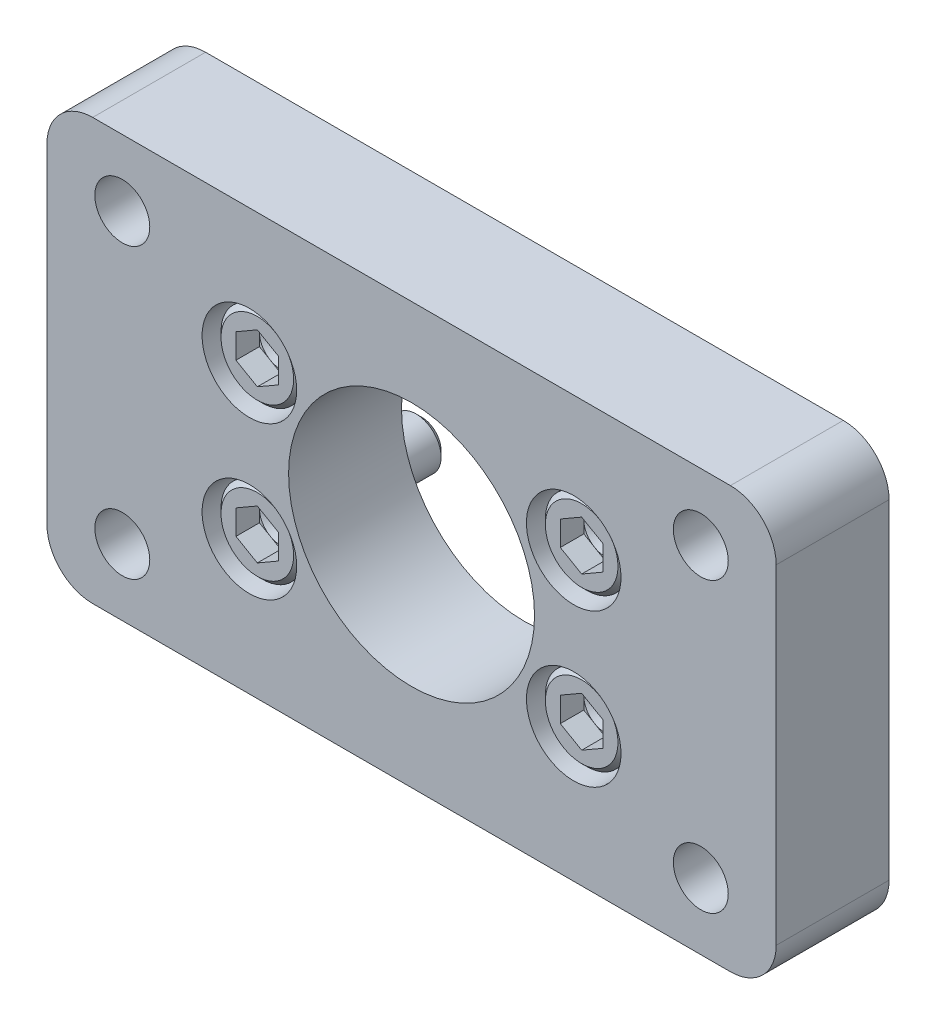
ISO-10303-21;
HEADER;
FILE_DESCRIPTION(('STEP AP214'),'2;1');
FILE_NAME('part.step','',(''),(''),'','','');
FILE_SCHEMA(('AUTOMOTIVE_DESIGN { 1 0 10303 214 1 1 1 1 }'));
ENDSEC;
DATA;
#1=APPLICATION_CONTEXT('core data for automotive mechanical design processes');
#2=APPLICATION_PROTOCOL_DEFINITION('international standard','automotive_design',2000,#1);
#3=PRODUCT_CONTEXT('',#1,'mechanical');
#4=PRODUCT('Part','Part','',(#3));
#5=PRODUCT_RELATED_PRODUCT_CATEGORY('part','',(#4));
#6=PRODUCT_DEFINITION_FORMATION('','',#4);
#7=PRODUCT_DEFINITION_CONTEXT('part definition',#1,'design');
#8=PRODUCT_DEFINITION('design','',#6,#7);
#9=PRODUCT_DEFINITION_SHAPE('','',#8);
#10=(LENGTH_UNIT() NAMED_UNIT(*) SI_UNIT(.MILLI.,.METRE.));
#11=(NAMED_UNIT(*) PLANE_ANGLE_UNIT() SI_UNIT($,.RADIAN.));
#12=(NAMED_UNIT(*) SI_UNIT($,.STERADIAN.) SOLID_ANGLE_UNIT());
#13=UNCERTAINTY_MEASURE_WITH_UNIT(LENGTH_MEASURE(1.E-05),#10,'distance_accuracy_value','');
#14=(GEOMETRIC_REPRESENTATION_CONTEXT(3) GLOBAL_UNCERTAINTY_ASSIGNED_CONTEXT((#13)) GLOBAL_UNIT_ASSIGNED_CONTEXT((#10,
#11,#12)) REPRESENTATION_CONTEXT('',''));
#15=CARTESIAN_POINT('',(0.,0.,0.));
#16=DIRECTION('',(0.,0.,1.));
#17=DIRECTION('',(1.,0.,0.));
#18=AXIS2_PLACEMENT_3D('',#15,#16,#17);
#19=CARTESIAN_POINT('',(13.5001,-4.73964,-4.953));
#20=DIRECTION('',(0.,0.,-1.));
#21=DIRECTION('',(-1.,0.,0.));
#22=AXIS2_PLACEMENT_3D('',#19,#20,#21);
#23=PLANE('',#22);
#24=CARTESIAN_POINT('',(13.5001,-6.35,-4.953));
#25=DIRECTION('',(0.,0.,1.));
#26=DIRECTION('',(1.,0.,0.));
#27=AXIS2_PLACEMENT_3D('',#24,#25,#26);
#28=CIRCLE('',#27,1.61036);
#29=CARTESIAN_POINT('',(15.11046,-6.35,-4.953));
#30=VERTEX_POINT('',#29);
#31=EDGE_CURVE('E688',#30,#30,#28,.T.);
#32=ORIENTED_EDGE('',*,*,#31,.F.);
#33=EDGE_LOOP('',(#32));
#34=FACE_BOUND('',#33,.T.);
#35=ADVANCED_FACE('F14',(#34),#23,.T.);
#36=CARTESIAN_POINT('',(13.5001,-6.35,-4.953));
#37=DIRECTION('',(0.,0.,1.));
#38=DIRECTION('',(1.,0.,0.));
#39=AXIS2_PLACEMENT_3D('',#36,#37,#38);
#40=CONICAL_SURFACE('',#39,1.61036,0.785398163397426);
#41=CARTESIAN_POINT('',(13.5001,-6.35,-4.48056));
#42=DIRECTION('',(0.,0.,1.));
#43=DIRECTION('',(1.,0.,0.));
#44=AXIS2_PLACEMENT_3D('',#41,#42,#43);
#45=CIRCLE('',#44,2.0828);
#46=CARTESIAN_POINT('',(15.5829,-6.35,-4.48056));
#47=VERTEX_POINT('',#46);
#48=EDGE_CURVE('E692',#47,#47,#45,.T.);
#49=ORIENTED_EDGE('',*,*,#48,.F.);
#50=EDGE_LOOP('',(#49));
#51=FACE_BOUND('',#50,.T.);
#52=ORIENTED_EDGE('',*,*,#31,.T.);
#53=EDGE_LOOP('',(#52));
#54=FACE_BOUND('',#53,.T.);
#55=ADVANCED_FACE('F730',(#51,#54),#40,.T.);
#56=CARTESIAN_POINT('',(13.5001,-6.35,40.4876));
#57=DIRECTION('',(0.,0.,1.));
#58=DIRECTION('',(1.,0.,0.));
#59=AXIS2_PLACEMENT_3D('',#56,#57,#58);
#60=CYLINDRICAL_SURFACE('',#59,2.0828);
#61=CARTESIAN_POINT('',(13.5001,-6.35,4.2672));
#62=DIRECTION('',(0.,0.,-1.));
#63=DIRECTION('',(-1.,0.,0.));
#64=AXIS2_PLACEMENT_3D('',#61,#62,#63);
#65=CIRCLE('',#64,2.0828);
#66=CARTESIAN_POINT('',(11.4173,-6.35,4.2672));
#67=VERTEX_POINT('',#66);
#68=EDGE_CURVE('E22',#67,#67,#65,.T.);
#69=ORIENTED_EDGE('',*,*,#68,.T.);
#70=EDGE_LOOP('',(#69));
#71=FACE_BOUND('',#70,.T.);
#72=ORIENTED_EDGE('',*,*,#48,.T.);
#73=EDGE_LOOP('',(#72));
#74=FACE_BOUND('',#73,.T.);
#75=ADVANCED_FACE('F706',(#71,#74),#60,.T.);
#76=CARTESIAN_POINT('',(13.5001,-6.35,4.2672));
#77=DIRECTION('',(0.,0.,-1.));
#78=DIRECTION('',(-1.,0.,0.));
#79=AXIS2_PLACEMENT_3D('',#76,#77,#78);
#80=TOROIDAL_SURFACE('',#79,2.3876,0.3048);
#81=ORIENTED_EDGE('',*,*,#68,.F.);
#82=EDGE_LOOP('',(#81));
#83=FACE_BOUND('',#82,.T.);
#84=CARTESIAN_POINT('',(13.5001,-6.35,4.55456819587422));
#85=DIRECTION('',(0.,0.,-1.));
#86=DIRECTION('',(-1.,0.,0.));
#87=AXIS2_PLACEMENT_3D('',#84,#85,#86);
#88=CIRCLE('',#87,2.286);
#89=CARTESIAN_POINT('',(11.2141,-6.35,4.55456819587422));
#90=VERTEX_POINT('',#89);
#91=EDGE_CURVE('E9',#90,#90,#88,.F.);
#92=ORIENTED_EDGE('',*,*,#91,.F.);
#93=EDGE_LOOP('',(#92));
#94=FACE_BOUND('',#93,.T.);
#95=ADVANCED_FACE('F709',(#83,#94),#80,.F.);
#96=CARTESIAN_POINT('',(13.5001,-6.35,8.7376));
#97=DIRECTION('',(0.,0.,1.));
#98=DIRECTION('',(1.,0.,0.));
#99=AXIS2_PLACEMENT_3D('',#96,#97,#98);
#100=PLANE('',#99);
#101=DIRECTION('',(0.866025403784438,-0.5,0.));
#102=VECTOR('',#101,1.);
#103=CARTESIAN_POINT('',(13.5001,-4.2969424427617,8.7376));
#104=LINE('',#103,#102);
#105=CARTESIAN_POINT('',(13.5001,-4.2969424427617,8.7376));
#106=VERTEX_POINT('',#105);
#107=CARTESIAN_POINT('',(15.2781,-5.32347122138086,8.7376));
#108=VERTEX_POINT('',#107);
#109=EDGE_CURVE('E628',#106,#108,#104,.T.);
#110=ORIENTED_EDGE('',*,*,#109,.T.);
#111=DIRECTION('',(0.,1.,0.));
#112=VECTOR('',#111,1.);
#113=CARTESIAN_POINT('',(15.2781,-7.37652877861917,8.7376));
#114=LINE('',#113,#112);
#115=CARTESIAN_POINT('',(15.2781,-7.37652877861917,8.7376));
#116=VERTEX_POINT('',#115);
#117=EDGE_CURVE('E631',#116,#108,#114,.T.);
#118=ORIENTED_EDGE('',*,*,#117,.F.);
#119=DIRECTION('',(-0.866025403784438,-0.5,0.));
#120=VECTOR('',#119,1.);
#121=CARTESIAN_POINT('',(15.2781,-7.37652877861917,8.7376));
#122=LINE('',#121,#120);
#123=CARTESIAN_POINT('',(13.5001,-8.40305755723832,8.7376));
#124=VERTEX_POINT('',#123);
#125=EDGE_CURVE('E633',#116,#124,#122,.T.);
#126=ORIENTED_EDGE('',*,*,#125,.T.);
#127=DIRECTION('',(-0.866025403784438,0.5,0.));
#128=VECTOR('',#127,1.);
#129=CARTESIAN_POINT('',(13.5001,-8.40305755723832,8.7376));
#130=LINE('',#129,#128);
#131=CARTESIAN_POINT('',(11.7221,-7.37652877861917,8.7376));
#132=VERTEX_POINT('',#131);
#133=EDGE_CURVE('E636',#124,#132,#130,.T.);
#134=ORIENTED_EDGE('',*,*,#133,.T.);
#135=DIRECTION('',(0.,-1.,0.));
#136=VECTOR('',#135,1.);
#137=CARTESIAN_POINT('',(11.7221,-5.32347122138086,8.7376));
#138=LINE('',#137,#136);
#139=CARTESIAN_POINT('',(11.7221,-5.32347122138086,8.7376));
#140=VERTEX_POINT('',#139);
#141=EDGE_CURVE('E639',#140,#132,#138,.T.);
#142=ORIENTED_EDGE('',*,*,#141,.F.);
#143=DIRECTION('',(-0.866025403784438,-0.5,0.));
#144=VECTOR('',#143,1.);
#145=CARTESIAN_POINT('',(13.5001,-4.2969424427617,8.7376));
#146=LINE('',#145,#144);
#147=EDGE_CURVE('E641',#106,#140,#146,.T.);
#148=ORIENTED_EDGE('',*,*,#147,.F.);
#149=EDGE_LOOP('',(#110,#118,#126,#134,#142,#148));
#150=FACE_BOUND('',#149,.T.);
#151=CARTESIAN_POINT('',(13.5001,-6.35,8.7376));
#152=DIRECTION('',(0.,0.,1.));
#153=DIRECTION('',(1.,0.,0.));
#154=AXIS2_PLACEMENT_3D('',#151,#152,#153);
#155=CIRCLE('',#154,3.0226);
#156=CARTESIAN_POINT('',(16.5227,-6.35,8.7376));
#157=VERTEX_POINT('',#156);
#158=EDGE_CURVE('E701',#157,#157,#155,.T.);
#159=ORIENTED_EDGE('',*,*,#158,.T.);
#160=EDGE_LOOP('',(#159));
#161=FACE_BOUND('',#160,.T.);
#162=ADVANCED_FACE('F16',(#150,#161),#100,.T.);
#163=CARTESIAN_POINT('',(13.5001,-6.35,8.7376));
#164=DIRECTION('',(0.,0.,-1.));
#165=DIRECTION('',(-1.,0.,0.));
#166=AXIS2_PLACEMENT_3D('',#163,#164,#165);
#167=CONICAL_SURFACE('',#166,3.0226,0.785398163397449);
#168=CARTESIAN_POINT('',(13.5001,-6.35,8.3312));
#169=DIRECTION('',(0.,0.,1.));
#170=DIRECTION('',(1.,0.,0.));
#171=AXIS2_PLACEMENT_3D('',#168,#169,#170);
#172=CIRCLE('',#171,3.429);
#173=CARTESIAN_POINT('',(16.9291,-6.35,8.3312));
#174=VERTEX_POINT('',#173);
#175=EDGE_CURVE('E698',#174,#174,#172,.T.);
#176=ORIENTED_EDGE('',*,*,#175,.T.);
#177=EDGE_LOOP('',(#176));
#178=FACE_BOUND('',#177,.T.);
#179=ORIENTED_EDGE('',*,*,#158,.F.);
#180=EDGE_LOOP('',(#179));
#181=FACE_BOUND('',#180,.T.);
#182=ADVANCED_FACE('F942',(#178,#181),#167,.T.);
#183=CARTESIAN_POINT('',(13.5001,-6.35,40.4876));
#184=DIRECTION('',(0.,0.,1.));
#185=DIRECTION('',(1.,0.,0.));
#186=AXIS2_PLACEMENT_3D('',#183,#184,#185);
#187=CYLINDRICAL_SURFACE('',#186,3.429);
#188=CARTESIAN_POINT('',(13.5001,-6.35,4.572));
#189=DIRECTION('',(0.,0.,1.));
#190=DIRECTION('',(1.,0.,0.));
#191=AXIS2_PLACEMENT_3D('',#188,#189,#190);
#192=CIRCLE('',#191,3.429);
#193=CARTESIAN_POINT('',(16.9291,-6.35,4.572));
#194=VERTEX_POINT('',#193);
#195=EDGE_CURVE('E695',#194,#194,#192,.T.);
#196=ORIENTED_EDGE('',*,*,#195,.T.);
#197=EDGE_LOOP('',(#196));
#198=FACE_BOUND('',#197,.T.);
#199=ORIENTED_EDGE('',*,*,#175,.F.);
#200=EDGE_LOOP('',(#199));
#201=FACE_BOUND('',#200,.T.);
#202=ADVANCED_FACE('F933',(#198,#201),#187,.T.);
#203=CARTESIAN_POINT('',(13.5001,-4.2969424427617,6.7818));
#204=DIRECTION('',(-0.5,-0.866025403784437,0.));
#205=DIRECTION('',(-0.866025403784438,0.5,0.));
#206=AXIS2_PLACEMENT_3D('',#203,#204,#205);
#207=PLANE('',#206);
#208=ORIENTED_EDGE('',*,*,#109,.F.);
#209=DIRECTION('',(0.,0.,1.));
#210=VECTOR('',#209,1.);
#211=CARTESIAN_POINT('',(13.5001,-4.2969424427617,6.7818));
#212=LINE('',#211,#210);
#213=CARTESIAN_POINT('',(13.5001,-4.2969424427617,6.7818));
#214=VERTEX_POINT('',#213);
#215=EDGE_CURVE('E666',#214,#106,#212,.T.);
#216=ORIENTED_EDGE('',*,*,#215,.F.);
#217=DIRECTION('',(0.866025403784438,-0.5,0.));
#218=VECTOR('',#217,1.);
#219=CARTESIAN_POINT('',(13.5001,-4.2969424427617,6.7818));
#220=LINE('',#219,#218);
#221=CARTESIAN_POINT('',(14.3891,-4.81020683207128,6.7818));
#222=VERTEX_POINT('',#221);
#223=EDGE_CURVE('E645',#214,#222,#220,.T.);
#224=ORIENTED_EDGE('',*,*,#223,.T.);
#225=CARTESIAN_POINT('',(15.2781,-5.32347122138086,6.7818));
#226=VERTEX_POINT('',#225);
#227=EDGE_CURVE('E644',#222,#226,#220,.T.);
#228=ORIENTED_EDGE('',*,*,#227,.T.);
#229=DIRECTION('',(0.,0.,1.));
#230=VECTOR('',#229,1.);
#231=CARTESIAN_POINT('',(15.2781,-5.32347122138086,6.7818));
#232=LINE('',#231,#230);
#233=EDGE_CURVE('E681',#226,#108,#232,.T.);
#234=ORIENTED_EDGE('',*,*,#233,.T.);
#235=EDGE_LOOP('',(#208,#216,#224,#228,#234));
#236=FACE_BOUND('',#235,.T.);
#237=ADVANCED_FACE('F930',(#236),#207,.T.);
#238=CARTESIAN_POINT('',(15.2781,-7.37652877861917,6.7818));
#239=DIRECTION('',(1.,0.,0.));
#240=DIRECTION('',(0.,-1.,0.));
#241=AXIS2_PLACEMENT_3D('',#238,#239,#240);
#242=PLANE('',#241);
#243=ORIENTED_EDGE('',*,*,#117,.T.);
#244=ORIENTED_EDGE('',*,*,#233,.F.);
#245=DIRECTION('',(0.,1.,0.));
#246=VECTOR('',#245,1.);
#247=CARTESIAN_POINT('',(15.2781,-7.37652877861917,6.7818));
#248=LINE('',#247,#246);
#249=CARTESIAN_POINT('',(15.2781,-6.35,6.7818));
#250=VERTEX_POINT('',#249);
#251=EDGE_CURVE('E648',#250,#226,#248,.T.);
#252=ORIENTED_EDGE('',*,*,#251,.F.);
#253=CARTESIAN_POINT('',(15.2781,-7.37652877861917,6.7818));
#254=VERTEX_POINT('',#253);
#255=EDGE_CURVE('E649',#254,#250,#248,.T.);
#256=ORIENTED_EDGE('',*,*,#255,.F.);
#257=DIRECTION('',(0.,0.,1.));
#258=VECTOR('',#257,1.);
#259=CARTESIAN_POINT('',(15.2781,-7.37652877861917,6.7818));
#260=LINE('',#259,#258);
#261=EDGE_CURVE('E678',#254,#116,#260,.T.);
#262=ORIENTED_EDGE('',*,*,#261,.T.);
#263=EDGE_LOOP('',(#243,#244,#252,#256,#262));
#264=FACE_BOUND('',#263,.T.);
#265=ADVANCED_FACE('F926',(#264),#242,.F.);
#266=CARTESIAN_POINT('',(15.2781,-7.37652877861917,6.7818));
#267=DIRECTION('',(-0.5,0.866025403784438,0.));
#268=DIRECTION('',(0.866025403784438,0.5,0.));
#269=AXIS2_PLACEMENT_3D('',#266,#267,#268);
#270=PLANE('',#269);
#271=ORIENTED_EDGE('',*,*,#125,.F.);
#272=ORIENTED_EDGE('',*,*,#261,.F.);
#273=DIRECTION('',(-0.866025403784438,-0.5,0.));
#274=VECTOR('',#273,1.);
#275=CARTESIAN_POINT('',(15.2781,-7.37652877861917,6.7818));
#276=LINE('',#275,#274);
#277=CARTESIAN_POINT('',(14.3891,-7.88979316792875,6.7818));
#278=VERTEX_POINT('',#277);
#279=EDGE_CURVE('E653',#254,#278,#276,.T.);
#280=ORIENTED_EDGE('',*,*,#279,.T.);
#281=CARTESIAN_POINT('',(13.5001,-8.40305755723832,6.7818));
#282=VERTEX_POINT('',#281);
#283=EDGE_CURVE('E652',#278,#282,#276,.T.);
#284=ORIENTED_EDGE('',*,*,#283,.T.);
#285=DIRECTION('',(0.,0.,1.));
#286=VECTOR('',#285,1.);
#287=CARTESIAN_POINT('',(13.5001,-8.40305755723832,6.7818));
#288=LINE('',#287,#286);
#289=EDGE_CURVE('E675',#282,#124,#288,.T.);
#290=ORIENTED_EDGE('',*,*,#289,.T.);
#291=EDGE_LOOP('',(#271,#272,#280,#284,#290));
#292=FACE_BOUND('',#291,.T.);
#293=ADVANCED_FACE('F922',(#292),#270,.T.);
#294=CARTESIAN_POINT('',(13.5001,-8.40305755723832,6.7818));
#295=DIRECTION('',(0.5,0.866025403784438,0.));
#296=DIRECTION('',(0.866025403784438,-0.5,0.));
#297=AXIS2_PLACEMENT_3D('',#294,#295,#296);
#298=PLANE('',#297);
#299=ORIENTED_EDGE('',*,*,#133,.F.);
#300=ORIENTED_EDGE('',*,*,#289,.F.);
#301=DIRECTION('',(-0.866025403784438,0.5,0.));
#302=VECTOR('',#301,1.);
#303=CARTESIAN_POINT('',(13.5001,-8.40305755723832,6.7818));
#304=LINE('',#303,#302);
#305=CARTESIAN_POINT('',(12.6111,-7.88979316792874,6.7818));
#306=VERTEX_POINT('',#305);
#307=EDGE_CURVE('E657',#282,#306,#304,.T.);
#308=ORIENTED_EDGE('',*,*,#307,.T.);
#309=CARTESIAN_POINT('',(11.7221,-7.37652877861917,6.7818));
#310=VERTEX_POINT('',#309);
#311=EDGE_CURVE('E656',#306,#310,#304,.T.);
#312=ORIENTED_EDGE('',*,*,#311,.T.);
#313=DIRECTION('',(0.,0.,1.));
#314=VECTOR('',#313,1.);
#315=CARTESIAN_POINT('',(11.7221,-7.37652877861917,6.7818));
#316=LINE('',#315,#314);
#317=EDGE_CURVE('E672',#310,#132,#316,.T.);
#318=ORIENTED_EDGE('',*,*,#317,.T.);
#319=EDGE_LOOP('',(#299,#300,#308,#312,#318));
#320=FACE_BOUND('',#319,.T.);
#321=ADVANCED_FACE('F918',(#320),#298,.T.);
#322=CARTESIAN_POINT('',(11.7221,-5.32347122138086,6.7818));
#323=DIRECTION('',(-1.,0.,0.));
#324=DIRECTION('',(0.,1.,0.));
#325=AXIS2_PLACEMENT_3D('',#322,#323,#324);
#326=PLANE('',#325);
#327=ORIENTED_EDGE('',*,*,#141,.T.);
#328=ORIENTED_EDGE('',*,*,#317,.F.);
#329=DIRECTION('',(0.,-1.,0.));
#330=VECTOR('',#329,1.);
#331=CARTESIAN_POINT('',(11.7221,-5.32347122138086,6.7818));
#332=LINE('',#331,#330);
#333=CARTESIAN_POINT('',(11.7221,-6.35,6.7818));
#334=VERTEX_POINT('',#333);
#335=EDGE_CURVE('E660',#334,#310,#332,.T.);
#336=ORIENTED_EDGE('',*,*,#335,.F.);
#337=CARTESIAN_POINT('',(11.7221,-5.32347122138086,6.7818));
#338=VERTEX_POINT('',#337);
#339=EDGE_CURVE('E29',#338,#334,#332,.T.);
#340=ORIENTED_EDGE('',*,*,#339,.F.);
#341=DIRECTION('',(0.,0.,1.));
#342=VECTOR('',#341,1.);
#343=CARTESIAN_POINT('',(11.7221,-5.32347122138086,6.7818));
#344=LINE('',#343,#342);
#345=EDGE_CURVE('E669',#338,#140,#344,.T.);
#346=ORIENTED_EDGE('',*,*,#345,.T.);
#347=EDGE_LOOP('',(#327,#328,#336,#340,#346));
#348=FACE_BOUND('',#347,.T.);
#349=ADVANCED_FACE('F914',(#348),#326,.F.);
#350=CARTESIAN_POINT('',(13.5001,-4.2969424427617,6.7818));
#351=DIRECTION('',(-0.5,0.866025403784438,0.));
#352=DIRECTION('',(0.866025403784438,0.5,0.));
#353=AXIS2_PLACEMENT_3D('',#350,#351,#352);
#354=PLANE('',#353);
#355=ORIENTED_EDGE('',*,*,#147,.T.);
#356=ORIENTED_EDGE('',*,*,#345,.F.);
#357=DIRECTION('',(-0.866025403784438,-0.5,0.));
#358=VECTOR('',#357,1.);
#359=CARTESIAN_POINT('',(13.5001,-4.2969424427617,6.7818));
#360=LINE('',#359,#358);
#361=CARTESIAN_POINT('',(12.6111,-4.81020683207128,6.7818));
#362=VERTEX_POINT('',#361);
#363=EDGE_CURVE('E662',#362,#338,#360,.T.);
#364=ORIENTED_EDGE('',*,*,#363,.F.);
#365=EDGE_CURVE('E663',#214,#362,#360,.T.);
#366=ORIENTED_EDGE('',*,*,#365,.F.);
#367=ORIENTED_EDGE('',*,*,#215,.T.);
#368=EDGE_LOOP('',(#355,#356,#364,#366,#367));
#369=FACE_BOUND('',#368,.T.);
#370=ADVANCED_FACE('F910',(#369),#354,.F.);
#371=CARTESIAN_POINT('',(13.5001,-4.2969424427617,6.7818));
#372=DIRECTION('',(0.,0.,-1.));
#373=DIRECTION('',(-1.,0.,0.));
#374=AXIS2_PLACEMENT_3D('',#371,#372,#373);
#375=PLANE('',#374);
#376=ORIENTED_EDGE('',*,*,#335,.T.);
#377=ORIENTED_EDGE('',*,*,#311,.F.);
#378=CARTESIAN_POINT('',(13.5001,-6.35,6.7818));
#379=DIRECTION('',(0.,0.,1.));
#380=DIRECTION('',(1.,0.,0.));
#381=AXIS2_PLACEMENT_3D('',#378,#379,#380);
#382=CIRCLE('',#381,1.778);
#383=EDGE_CURVE('E974',#334,#306,#382,.T.);
#384=ORIENTED_EDGE('',*,*,#383,.F.);
#385=EDGE_LOOP('',(#376,#377,#384));
#386=FACE_BOUND('',#385,.T.);
#387=ADVANCED_FACE('F906',(#386),#375,.F.);
#388=ORIENTED_EDGE('',*,*,#307,.F.);
#389=ORIENTED_EDGE('',*,*,#283,.F.);
#390=EDGE_CURVE('E975',#306,#278,#382,.T.);
#391=ORIENTED_EDGE('',*,*,#390,.F.);
#392=EDGE_LOOP('',(#388,#389,#391));
#393=FACE_BOUND('',#392,.T.);
#394=ADVANCED_FACE('F909',(#393),#375,.F.);
#395=ORIENTED_EDGE('',*,*,#279,.F.);
#396=ORIENTED_EDGE('',*,*,#255,.T.);
#397=EDGE_CURVE('E684',#278,#250,#382,.T.);
#398=ORIENTED_EDGE('',*,*,#397,.F.);
#399=EDGE_LOOP('',(#395,#396,#398));
#400=FACE_BOUND('',#399,.T.);
#401=ADVANCED_FACE('F981',(#400),#375,.F.);
#402=ORIENTED_EDGE('',*,*,#251,.T.);
#403=ORIENTED_EDGE('',*,*,#227,.F.);
#404=EDGE_CURVE('E685',#250,#222,#382,.T.);
#405=ORIENTED_EDGE('',*,*,#404,.F.);
#406=EDGE_LOOP('',(#402,#403,#405));
#407=FACE_BOUND('',#406,.T.);
#408=ADVANCED_FACE('F989',(#407),#375,.F.);
#409=ORIENTED_EDGE('',*,*,#223,.F.);
#410=ORIENTED_EDGE('',*,*,#365,.T.);
#411=EDGE_CURVE('E689',#222,#362,#382,.T.);
#412=ORIENTED_EDGE('',*,*,#411,.F.);
#413=EDGE_LOOP('',(#409,#410,#412));
#414=FACE_BOUND('',#413,.T.);
#415=ADVANCED_FACE('F967',(#414),#375,.F.);
#416=ORIENTED_EDGE('',*,*,#363,.T.);
#417=ORIENTED_EDGE('',*,*,#339,.T.);
#418=EDGE_CURVE('E972',#362,#334,#382,.T.);
#419=ORIENTED_EDGE('',*,*,#418,.F.);
#420=EDGE_LOOP('',(#416,#417,#419));
#421=FACE_BOUND('',#420,.T.);
#422=ADVANCED_FACE('F746',(#421),#375,.F.);
#423=CARTESIAN_POINT('',(13.5001,-6.35,6.7818));
#424=DIRECTION('',(0.,0.,1.));
#425=DIRECTION('',(1.,0.,0.));
#426=AXIS2_PLACEMENT_3D('',#423,#424,#425);
#427=CONICAL_SURFACE('',#426,1.778,1.04719755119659);
#428=CARTESIAN_POINT('',(13.5001,-6.35,5.75527122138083));
#429=VERTEX_POINT('',#428);
#430=VERTEX_LOOP('',#429);
#431=FACE_BOUND('',#430,.T.);
#432=ORIENTED_EDGE('',*,*,#404,.T.);
#433=ORIENTED_EDGE('',*,*,#411,.T.);
#434=ORIENTED_EDGE('',*,*,#418,.T.);
#435=ORIENTED_EDGE('',*,*,#383,.T.);
#436=ORIENTED_EDGE('',*,*,#390,.T.);
#437=ORIENTED_EDGE('',*,*,#397,.T.);
#438=EDGE_LOOP('',(#432,#433,#434,#435,#436,#437));
#439=FACE_BOUND('',#438,.T.);
#440=ADVANCED_FACE('F736',(#431,#439),#427,.F.);
#441=CARTESIAN_POINT('',(-13.5001,6.35,6.7818));
#442=DIRECTION('',(0.,0.,1.));
#443=DIRECTION('',(1.,0.,0.));
#444=AXIS2_PLACEMENT_3D('',#441,#442,#443);
#445=CONICAL_SURFACE('',#444,1.778,1.04719755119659);
#446=CARTESIAN_POINT('',(-13.5001,6.35,5.75527122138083));
#447=VERTEX_POINT('',#446);
#448=VERTEX_LOOP('',#447);
#449=FACE_BOUND('',#448,.T.);
#450=CARTESIAN_POINT('',(-13.5001,6.35,6.7818));
#451=DIRECTION('',(0.,0.,1.));
#452=DIRECTION('',(1.,0.,0.));
#453=AXIS2_PLACEMENT_3D('',#450,#451,#452);
#454=CIRCLE('',#453,1.778);
#455=CARTESIAN_POINT('',(-11.7221,6.35,6.7818));
#456=VERTEX_POINT('',#455);
#457=CARTESIAN_POINT('',(-12.6111,7.88979316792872,6.7818));
#458=VERTEX_POINT('',#457);
#459=EDGE_CURVE('E437',#456,#458,#454,.T.);
#460=ORIENTED_EDGE('',*,*,#459,.T.);
#461=CARTESIAN_POINT('',(-14.3891,7.88979316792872,6.7818));
#462=VERTEX_POINT('',#461);
#463=EDGE_CURVE('E441',#458,#462,#454,.T.);
#464=ORIENTED_EDGE('',*,*,#463,.T.);
#465=CARTESIAN_POINT('',(-15.2781,6.35,6.7818));
#466=VERTEX_POINT('',#465);
#467=EDGE_CURVE('E2179',#462,#466,#454,.T.);
#468=ORIENTED_EDGE('',*,*,#467,.T.);
#469=CARTESIAN_POINT('',(-14.3891,4.81020683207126,6.7818));
#470=VERTEX_POINT('',#469);
#471=EDGE_CURVE('E2177',#466,#470,#454,.T.);
#472=ORIENTED_EDGE('',*,*,#471,.T.);
#473=CARTESIAN_POINT('',(-12.6111,4.81020683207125,6.7818));
#474=VERTEX_POINT('',#473);
#475=EDGE_CURVE('E2183',#470,#474,#454,.T.);
#476=ORIENTED_EDGE('',*,*,#475,.T.);
#477=EDGE_CURVE('E436',#474,#456,#454,.T.);
#478=ORIENTED_EDGE('',*,*,#477,.T.);
#479=EDGE_LOOP('',(#460,#464,#468,#472,#476,#478));
#480=FACE_BOUND('',#479,.T.);
#481=ADVANCED_FACE('F733',(#449,#480),#445,.F.);
#482=CARTESIAN_POINT('',(13.5001,6.35,6.7818));
#483=DIRECTION('',(0.,0.,1.));
#484=DIRECTION('',(1.,0.,0.));
#485=AXIS2_PLACEMENT_3D('',#482,#483,#484);
#486=CONICAL_SURFACE('',#485,1.778,1.04719755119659);
#487=CARTESIAN_POINT('',(13.5001,6.35,5.75527122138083));
#488=VERTEX_POINT('',#487);
#489=VERTEX_LOOP('',#488);
#490=FACE_BOUND('',#489,.T.);
#491=CARTESIAN_POINT('',(13.5001,6.35,6.7818));
#492=DIRECTION('',(0.,0.,1.));
#493=DIRECTION('',(1.,0.,0.));
#494=AXIS2_PLACEMENT_3D('',#491,#492,#493);
#495=CIRCLE('',#494,1.778);
#496=CARTESIAN_POINT('',(15.2781,6.35,6.7818));
#497=VERTEX_POINT('',#496);
#498=CARTESIAN_POINT('',(14.3891,7.88979316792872,6.7818));
#499=VERTEX_POINT('',#498);
#500=EDGE_CURVE('E603',#497,#499,#495,.T.);
#501=ORIENTED_EDGE('',*,*,#500,.T.);
#502=CARTESIAN_POINT('',(12.6111,7.88979316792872,6.7818));
#503=VERTEX_POINT('',#502);
#504=EDGE_CURVE('E607',#499,#503,#495,.T.);
#505=ORIENTED_EDGE('',*,*,#504,.T.);
#506=CARTESIAN_POINT('',(11.7221,6.35,6.7818));
#507=VERTEX_POINT('',#506);
#508=EDGE_CURVE('E2230',#503,#507,#495,.T.);
#509=ORIENTED_EDGE('',*,*,#508,.T.);
#510=CARTESIAN_POINT('',(12.6111,4.81020683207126,6.7818));
#511=VERTEX_POINT('',#510);
#512=EDGE_CURVE('E2233',#507,#511,#495,.T.);
#513=ORIENTED_EDGE('',*,*,#512,.T.);
#514=CARTESIAN_POINT('',(14.3891,4.81020683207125,6.7818));
#515=VERTEX_POINT('',#514);
#516=EDGE_CURVE('E2234',#511,#515,#495,.T.);
#517=ORIENTED_EDGE('',*,*,#516,.T.);
#518=EDGE_CURVE('E602',#515,#497,#495,.T.);
#519=ORIENTED_EDGE('',*,*,#518,.T.);
#520=EDGE_LOOP('',(#501,#505,#509,#513,#517,#519));
#521=FACE_BOUND('',#520,.T.);
#522=ADVANCED_FACE('F735',(#490,#521),#486,.F.);
#523=CARTESIAN_POINT('',(-13.5001,-6.35,6.7818));
#524=DIRECTION('',(0.,0.,1.));
#525=DIRECTION('',(1.,0.,0.));
#526=AXIS2_PLACEMENT_3D('',#523,#524,#525);
#527=CONICAL_SURFACE('',#526,1.778,1.04719755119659);
#528=CARTESIAN_POINT('',(-13.5001,-6.35,5.75527122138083));
#529=VERTEX_POINT('',#528);
#530=VERTEX_LOOP('',#529);
#531=FACE_BOUND('',#530,.T.);
#532=CARTESIAN_POINT('',(-13.5001,-6.35,6.7818));
#533=DIRECTION('',(0.,0.,1.));
#534=DIRECTION('',(1.,0.,0.));
#535=AXIS2_PLACEMENT_3D('',#532,#533,#534);
#536=CIRCLE('',#535,1.778);
#537=CARTESIAN_POINT('',(-11.7221,-6.35,6.7818));
#538=VERTEX_POINT('',#537);
#539=CARTESIAN_POINT('',(-12.6111,-4.81020683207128,6.7818));
#540=VERTEX_POINT('',#539);
#541=EDGE_CURVE('E520',#538,#540,#536,.T.);
#542=ORIENTED_EDGE('',*,*,#541,.T.);
#543=CARTESIAN_POINT('',(-14.3891,-4.81020683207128,6.7818));
#544=VERTEX_POINT('',#543);
#545=EDGE_CURVE('E524',#540,#544,#536,.T.);
#546=ORIENTED_EDGE('',*,*,#545,.T.);
#547=CARTESIAN_POINT('',(-15.2781,-6.35,6.7818));
#548=VERTEX_POINT('',#547);
#549=EDGE_CURVE('E2200',#544,#548,#536,.T.);
#550=ORIENTED_EDGE('',*,*,#549,.T.);
#551=CARTESIAN_POINT('',(-14.3891,-7.88979316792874,6.7818));
#552=VERTEX_POINT('',#551);
#553=EDGE_CURVE('E2203',#548,#552,#536,.T.);
#554=ORIENTED_EDGE('',*,*,#553,.T.);
#555=CARTESIAN_POINT('',(-12.6111,-7.88979316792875,6.7818));
#556=VERTEX_POINT('',#555);
#557=EDGE_CURVE('E2204',#552,#556,#536,.T.);
#558=ORIENTED_EDGE('',*,*,#557,.T.);
#559=EDGE_CURVE('E519',#556,#538,#536,.T.);
#560=ORIENTED_EDGE('',*,*,#559,.T.);
#561=EDGE_LOOP('',(#542,#546,#550,#554,#558,#560));
#562=FACE_BOUND('',#561,.T.);
#563=ADVANCED_FACE('F743',(#531,#562),#527,.F.);
#564=CARTESIAN_POINT('',(-13.5001,8.4030575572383,6.7818));
#565=DIRECTION('',(0.,0.,-1.));
#566=DIRECTION('',(-1.,0.,0.));
#567=AXIS2_PLACEMENT_3D('',#564,#565,#566);
#568=PLANE('',#567);
#569=DIRECTION('',(-0.866025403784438,-0.5,0.));
#570=VECTOR('',#569,1.);
#571=CARTESIAN_POINT('',(-13.5001,8.4030575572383,6.7818));
#572=LINE('',#571,#570);
#573=CARTESIAN_POINT('',(-15.2781,7.37652877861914,6.7818));
#574=VERTEX_POINT('',#573);
#575=EDGE_CURVE('E414',#462,#574,#572,.T.);
#576=ORIENTED_EDGE('',*,*,#575,.T.);
#577=DIRECTION('',(0.,-1.,0.));
#578=VECTOR('',#577,1.);
#579=CARTESIAN_POINT('',(-15.2781,7.37652877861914,6.7818));
#580=LINE('',#579,#578);
#581=EDGE_CURVE('E412',#574,#466,#580,.T.);
#582=ORIENTED_EDGE('',*,*,#581,.T.);
#583=ORIENTED_EDGE('',*,*,#467,.F.);
#584=EDGE_LOOP('',(#576,#582,#583));
#585=FACE_BOUND('',#584,.T.);
#586=ADVANCED_FACE('F827',(#585),#568,.F.);
#587=CARTESIAN_POINT('',(-15.2781,5.32347122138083,6.7818));
#588=VERTEX_POINT('',#587);
#589=EDGE_CURVE('E411',#466,#588,#580,.T.);
#590=ORIENTED_EDGE('',*,*,#589,.T.);
#591=DIRECTION('',(-0.866025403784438,0.5,0.));
#592=VECTOR('',#591,1.);
#593=CARTESIAN_POINT('',(-13.5001,4.29694244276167,6.7818));
#594=LINE('',#593,#592);
#595=EDGE_CURVE('E407',#470,#588,#594,.T.);
#596=ORIENTED_EDGE('',*,*,#595,.F.);
#597=ORIENTED_EDGE('',*,*,#471,.F.);
#598=EDGE_LOOP('',(#590,#596,#597));
#599=FACE_BOUND('',#598,.T.);
#600=ADVANCED_FACE('F1398',(#599),#568,.F.);
#601=CARTESIAN_POINT('',(-13.5001,4.29694244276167,6.7818));
#602=VERTEX_POINT('',#601);
#603=EDGE_CURVE('E408',#602,#470,#594,.T.);
#604=ORIENTED_EDGE('',*,*,#603,.F.);
#605=DIRECTION('',(-0.866025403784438,-0.5,0.));
#606=VECTOR('',#605,1.);
#607=CARTESIAN_POINT('',(-11.7221,5.32347122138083,6.7818));
#608=LINE('',#607,#606);
#609=EDGE_CURVE('E403',#474,#602,#608,.T.);
#610=ORIENTED_EDGE('',*,*,#609,.F.);
#611=ORIENTED_EDGE('',*,*,#475,.F.);
#612=EDGE_LOOP('',(#604,#610,#611));
#613=FACE_BOUND('',#612,.T.);
#614=ADVANCED_FACE('F1409',(#613),#568,.F.);
#615=CARTESIAN_POINT('',(-11.7221,5.32347122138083,6.7818));
#616=VERTEX_POINT('',#615);
#617=EDGE_CURVE('E404',#616,#474,#608,.T.);
#618=ORIENTED_EDGE('',*,*,#617,.F.);
#619=DIRECTION('',(0.,1.,0.));
#620=VECTOR('',#619,1.);
#621=CARTESIAN_POINT('',(-11.7221,5.32347122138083,6.7818));
#622=LINE('',#621,#620);
#623=EDGE_CURVE('E400',#616,#456,#622,.T.);
#624=ORIENTED_EDGE('',*,*,#623,.T.);
#625=ORIENTED_EDGE('',*,*,#477,.F.);
#626=EDGE_LOOP('',(#618,#624,#625));
#627=FACE_BOUND('',#626,.T.);
#628=ADVANCED_FACE('F1418',(#627),#568,.F.);
#629=CARTESIAN_POINT('',(-11.7221,7.37652877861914,6.7818));
#630=VERTEX_POINT('',#629);
#631=EDGE_CURVE('E399',#456,#630,#622,.T.);
#632=ORIENTED_EDGE('',*,*,#631,.T.);
#633=DIRECTION('',(0.866025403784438,-0.5,0.));
#634=VECTOR('',#633,1.);
#635=CARTESIAN_POINT('',(-13.5001,8.4030575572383,6.7818));
#636=LINE('',#635,#634);
#637=EDGE_CURVE('E395',#458,#630,#636,.T.);
#638=ORIENTED_EDGE('',*,*,#637,.F.);
#639=ORIENTED_EDGE('',*,*,#459,.F.);
#640=EDGE_LOOP('',(#632,#638,#639));
#641=FACE_BOUND('',#640,.T.);
#642=ADVANCED_FACE('F1427',(#641),#568,.F.);
#643=CARTESIAN_POINT('',(-13.5001,8.4030575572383,6.7818));
#644=VERTEX_POINT('',#643);
#645=EDGE_CURVE('E396',#644,#458,#636,.T.);
#646=ORIENTED_EDGE('',*,*,#645,.F.);
#647=EDGE_CURVE('E415',#644,#462,#572,.T.);
#648=ORIENTED_EDGE('',*,*,#647,.T.);
#649=ORIENTED_EDGE('',*,*,#463,.F.);
#650=EDGE_LOOP('',(#646,#648,#649));
#651=FACE_BOUND('',#650,.T.);
#652=ADVANCED_FACE('F1401',(#651),#568,.F.);
#653=CARTESIAN_POINT('',(13.5001,8.4030575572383,6.7818));
#654=DIRECTION('',(0.,0.,-1.));
#655=DIRECTION('',(-1.,0.,0.));
#656=AXIS2_PLACEMENT_3D('',#653,#654,#655);
#657=PLANE('',#656);
#658=DIRECTION('',(-0.866025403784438,-0.5,0.));
#659=VECTOR('',#658,1.);
#660=CARTESIAN_POINT('',(13.5001,8.4030575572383,6.7818));
#661=LINE('',#660,#659);
#662=CARTESIAN_POINT('',(11.7221,7.37652877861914,6.7818));
#663=VERTEX_POINT('',#662);
#664=EDGE_CURVE('E580',#503,#663,#661,.T.);
#665=ORIENTED_EDGE('',*,*,#664,.T.);
#666=DIRECTION('',(0.,-1.,0.));
#667=VECTOR('',#666,1.);
#668=CARTESIAN_POINT('',(11.7221,7.37652877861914,6.7818));
#669=LINE('',#668,#667);
#670=EDGE_CURVE('E578',#663,#507,#669,.T.);
#671=ORIENTED_EDGE('',*,*,#670,.T.);
#672=ORIENTED_EDGE('',*,*,#508,.F.);
#673=EDGE_LOOP('',(#665,#671,#672));
#674=FACE_BOUND('',#673,.T.);
#675=ADVANCED_FACE('F860',(#674),#657,.F.);
#676=CARTESIAN_POINT('',(11.7221,5.32347122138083,6.7818));
#677=VERTEX_POINT('',#676);
#678=EDGE_CURVE('E577',#507,#677,#669,.T.);
#679=ORIENTED_EDGE('',*,*,#678,.T.);
#680=DIRECTION('',(-0.866025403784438,0.5,0.));
#681=VECTOR('',#680,1.);
#682=CARTESIAN_POINT('',(13.5001,4.29694244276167,6.7818));
#683=LINE('',#682,#681);
#684=EDGE_CURVE('E573',#511,#677,#683,.T.);
#685=ORIENTED_EDGE('',*,*,#684,.F.);
#686=ORIENTED_EDGE('',*,*,#512,.F.);
#687=EDGE_LOOP('',(#679,#685,#686));
#688=FACE_BOUND('',#687,.T.);
#689=ADVANCED_FACE('F856',(#688),#657,.F.);
#690=CARTESIAN_POINT('',(13.5001,4.29694244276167,6.7818));
#691=VERTEX_POINT('',#690);
#692=EDGE_CURVE('E574',#691,#511,#683,.T.);
#693=ORIENTED_EDGE('',*,*,#692,.F.);
#694=DIRECTION('',(-0.866025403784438,-0.5,0.));
#695=VECTOR('',#694,1.);
#696=CARTESIAN_POINT('',(15.2781,5.32347122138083,6.7818));
#697=LINE('',#696,#695);
#698=EDGE_CURVE('E569',#515,#691,#697,.T.);
#699=ORIENTED_EDGE('',*,*,#698,.F.);
#700=ORIENTED_EDGE('',*,*,#516,.F.);
#701=EDGE_LOOP('',(#693,#699,#700));
#702=FACE_BOUND('',#701,.T.);
#703=ADVANCED_FACE('F859',(#702),#657,.F.);
#704=CARTESIAN_POINT('',(15.2781,5.32347122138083,6.7818));
#705=VERTEX_POINT('',#704);
#706=EDGE_CURVE('E570',#705,#515,#697,.T.);
#707=ORIENTED_EDGE('',*,*,#706,.F.);
#708=DIRECTION('',(0.,1.,0.));
#709=VECTOR('',#708,1.);
#710=CARTESIAN_POINT('',(15.2781,5.32347122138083,6.7818));
#711=LINE('',#710,#709);
#712=EDGE_CURVE('E566',#705,#497,#711,.T.);
#713=ORIENTED_EDGE('',*,*,#712,.T.);
#714=ORIENTED_EDGE('',*,*,#518,.F.);
#715=EDGE_LOOP('',(#707,#713,#714));
#716=FACE_BOUND('',#715,.T.);
#717=ADVANCED_FACE('F1459',(#716),#657,.F.);
#718=CARTESIAN_POINT('',(15.2781,7.37652877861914,6.7818));
#719=VERTEX_POINT('',#718);
#720=EDGE_CURVE('E565',#497,#719,#711,.T.);
#721=ORIENTED_EDGE('',*,*,#720,.T.);
#722=DIRECTION('',(0.866025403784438,-0.5,0.));
#723=VECTOR('',#722,1.);
#724=CARTESIAN_POINT('',(13.5001,8.4030575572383,6.7818));
#725=LINE('',#724,#723);
#726=EDGE_CURVE('E561',#499,#719,#725,.T.);
#727=ORIENTED_EDGE('',*,*,#726,.F.);
#728=ORIENTED_EDGE('',*,*,#500,.F.);
#729=EDGE_LOOP('',(#721,#727,#728));
#730=FACE_BOUND('',#729,.T.);
#731=ADVANCED_FACE('F1468',(#730),#657,.F.);
#732=CARTESIAN_POINT('',(13.5001,8.4030575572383,6.7818));
#733=VERTEX_POINT('',#732);
#734=EDGE_CURVE('E562',#733,#499,#725,.T.);
#735=ORIENTED_EDGE('',*,*,#734,.F.);
#736=EDGE_CURVE('E581',#733,#503,#661,.T.);
#737=ORIENTED_EDGE('',*,*,#736,.T.);
#738=ORIENTED_EDGE('',*,*,#504,.F.);
#739=EDGE_LOOP('',(#735,#737,#738));
#740=FACE_BOUND('',#739,.T.);
#741=ADVANCED_FACE('F1452',(#740),#657,.F.);
#742=CARTESIAN_POINT('',(-13.5001,-4.2969424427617,6.7818));
#743=DIRECTION('',(0.,0.,-1.));
#744=DIRECTION('',(-1.,0.,0.));
#745=AXIS2_PLACEMENT_3D('',#742,#743,#744);
#746=PLANE('',#745);
#747=DIRECTION('',(-0.866025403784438,-0.5,0.));
#748=VECTOR('',#747,1.);
#749=CARTESIAN_POINT('',(-13.5001,-4.2969424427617,6.7818));
#750=LINE('',#749,#748);
#751=CARTESIAN_POINT('',(-15.2781,-5.32347122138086,6.7818));
#752=VERTEX_POINT('',#751);
#753=EDGE_CURVE('E497',#544,#752,#750,.T.);
#754=ORIENTED_EDGE('',*,*,#753,.T.);
#755=DIRECTION('',(0.,-1.,0.));
#756=VECTOR('',#755,1.);
#757=CARTESIAN_POINT('',(-15.2781,-5.32347122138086,6.7818));
#758=LINE('',#757,#756);
#759=EDGE_CURVE('E495',#752,#548,#758,.T.);
#760=ORIENTED_EDGE('',*,*,#759,.T.);
#761=ORIENTED_EDGE('',*,*,#549,.F.);
#762=EDGE_LOOP('',(#754,#760,#761));
#763=FACE_BOUND('',#762,.T.);
#764=ADVANCED_FACE('F799',(#763),#746,.F.);
#765=CARTESIAN_POINT('',(-15.2781,-7.37652877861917,6.7818));
#766=VERTEX_POINT('',#765);
#767=EDGE_CURVE('E494',#548,#766,#758,.T.);
#768=ORIENTED_EDGE('',*,*,#767,.T.);
#769=DIRECTION('',(-0.866025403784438,0.5,0.));
#770=VECTOR('',#769,1.);
#771=CARTESIAN_POINT('',(-13.5001,-8.40305755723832,6.7818));
#772=LINE('',#771,#770);
#773=EDGE_CURVE('E490',#552,#766,#772,.T.);
#774=ORIENTED_EDGE('',*,*,#773,.F.);
#775=ORIENTED_EDGE('',*,*,#553,.F.);
#776=EDGE_LOOP('',(#768,#774,#775));
#777=FACE_BOUND('',#776,.T.);
#778=ADVANCED_FACE('F795',(#777),#746,.F.);
#779=CARTESIAN_POINT('',(-13.5001,-8.40305755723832,6.7818));
#780=VERTEX_POINT('',#779);
#781=EDGE_CURVE('E491',#780,#552,#772,.T.);
#782=ORIENTED_EDGE('',*,*,#781,.F.);
#783=DIRECTION('',(-0.866025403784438,-0.5,0.));
#784=VECTOR('',#783,1.);
#785=CARTESIAN_POINT('',(-11.7221,-7.37652877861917,6.7818));
#786=LINE('',#785,#784);
#787=EDGE_CURVE('E486',#556,#780,#786,.T.);
#788=ORIENTED_EDGE('',*,*,#787,.F.);
#789=ORIENTED_EDGE('',*,*,#557,.F.);
#790=EDGE_LOOP('',(#782,#788,#789));
#791=FACE_BOUND('',#790,.T.);
#792=ADVANCED_FACE('F798',(#791),#746,.F.);
#793=CARTESIAN_POINT('',(-11.7221,-7.37652877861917,6.7818));
#794=VERTEX_POINT('',#793);
#795=EDGE_CURVE('E487',#794,#556,#786,.T.);
#796=ORIENTED_EDGE('',*,*,#795,.F.);
#797=DIRECTION('',(0.,1.,0.));
#798=VECTOR('',#797,1.);
#799=CARTESIAN_POINT('',(-11.7221,-7.37652877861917,6.7818));
#800=LINE('',#799,#798);
#801=EDGE_CURVE('E483',#794,#538,#800,.T.);
#802=ORIENTED_EDGE('',*,*,#801,.T.);
#803=ORIENTED_EDGE('',*,*,#559,.F.);
#804=EDGE_LOOP('',(#796,#802,#803));
#805=FACE_BOUND('',#804,.T.);
#806=ADVANCED_FACE('F1500',(#805),#746,.F.);
#807=CARTESIAN_POINT('',(-11.7221,-5.32347122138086,6.7818));
#808=VERTEX_POINT('',#807);
#809=EDGE_CURVE('E482',#538,#808,#800,.T.);
#810=ORIENTED_EDGE('',*,*,#809,.T.);
#811=DIRECTION('',(0.866025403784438,-0.5,0.));
#812=VECTOR('',#811,1.);
#813=CARTESIAN_POINT('',(-13.5001,-4.2969424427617,6.7818));
#814=LINE('',#813,#812);
#815=EDGE_CURVE('E478',#540,#808,#814,.T.);
#816=ORIENTED_EDGE('',*,*,#815,.F.);
#817=ORIENTED_EDGE('',*,*,#541,.F.);
#818=EDGE_LOOP('',(#810,#816,#817));
#819=FACE_BOUND('',#818,.T.);
#820=ADVANCED_FACE('F1509',(#819),#746,.F.);
#821=CARTESIAN_POINT('',(-13.5001,-4.2969424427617,6.7818));
#822=VERTEX_POINT('',#821);
#823=EDGE_CURVE('E479',#822,#540,#814,.T.);
#824=ORIENTED_EDGE('',*,*,#823,.F.);
#825=EDGE_CURVE('E498',#822,#544,#750,.T.);
#826=ORIENTED_EDGE('',*,*,#825,.T.);
#827=ORIENTED_EDGE('',*,*,#545,.F.);
#828=EDGE_LOOP('',(#824,#826,#827));
#829=FACE_BOUND('',#828,.T.);
#830=ADVANCED_FACE('F1493',(#829),#746,.F.);
#831=CARTESIAN_POINT('',(-13.5001,8.4030575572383,6.7818));
#832=DIRECTION('',(-0.5,0.866025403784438,0.));
#833=DIRECTION('',(0.866025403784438,0.5,0.));
#834=AXIS2_PLACEMENT_3D('',#831,#832,#833);
#835=PLANE('',#834);
#836=DIRECTION('',(-0.866025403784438,-0.5,0.));
#837=VECTOR('',#836,1.);
#838=CARTESIAN_POINT('',(-13.5001,8.4030575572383,8.7376));
#839=LINE('',#838,#837);
#840=CARTESIAN_POINT('',(-13.5001,8.4030575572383,8.7376));
#841=VERTEX_POINT('',#840);
#842=CARTESIAN_POINT('',(-15.2781,7.37652877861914,8.7376));
#843=VERTEX_POINT('',#842);
#844=EDGE_CURVE('E392',#841,#843,#839,.T.);
#845=ORIENTED_EDGE('',*,*,#844,.T.);
#846=DIRECTION('',(0.,0.,1.));
#847=VECTOR('',#846,1.);
#848=CARTESIAN_POINT('',(-15.2781,7.37652877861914,6.7818));
#849=LINE('',#848,#847);
#850=EDGE_CURVE('E421',#574,#843,#849,.T.);
#851=ORIENTED_EDGE('',*,*,#850,.F.);
#852=ORIENTED_EDGE('',*,*,#575,.F.);
#853=ORIENTED_EDGE('',*,*,#647,.F.);
#854=DIRECTION('',(0.,0.,1.));
#855=VECTOR('',#854,1.);
#856=CARTESIAN_POINT('',(-13.5001,8.4030575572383,6.7818));
#857=LINE('',#856,#855);
#858=EDGE_CURVE('E418',#644,#841,#857,.T.);
#859=ORIENTED_EDGE('',*,*,#858,.T.);
#860=EDGE_LOOP('',(#845,#851,#852,#853,#859));
#861=FACE_BOUND('',#860,.T.);
#862=ADVANCED_FACE('F1526',(#861),#835,.F.);
#863=CARTESIAN_POINT('',(-15.2781,7.37652877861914,6.7818));
#864=DIRECTION('',(-1.,0.,0.));
#865=DIRECTION('',(0.,1.,0.));
#866=AXIS2_PLACEMENT_3D('',#863,#864,#865);
#867=PLANE('',#866);
#868=DIRECTION('',(0.,-1.,0.));
#869=VECTOR('',#868,1.);
#870=CARTESIAN_POINT('',(-15.2781,7.37652877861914,8.7376));
#871=LINE('',#870,#869);
#872=CARTESIAN_POINT('',(-15.2781,5.32347122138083,8.7376));
#873=VERTEX_POINT('',#872);
#874=EDGE_CURVE('E390',#843,#873,#871,.T.);
#875=ORIENTED_EDGE('',*,*,#874,.T.);
#876=DIRECTION('',(0.,0.,1.));
#877=VECTOR('',#876,1.);
#878=CARTESIAN_POINT('',(-15.2781,5.32347122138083,6.7818));
#879=LINE('',#878,#877);
#880=EDGE_CURVE('E424',#588,#873,#879,.T.);
#881=ORIENTED_EDGE('',*,*,#880,.F.);
#882=ORIENTED_EDGE('',*,*,#589,.F.);
#883=ORIENTED_EDGE('',*,*,#581,.F.);
#884=ORIENTED_EDGE('',*,*,#850,.T.);
#885=EDGE_LOOP('',(#875,#881,#882,#883,#884));
#886=FACE_BOUND('',#885,.T.);
#887=ADVANCED_FACE('F1535',(#886),#867,.F.);
#888=CARTESIAN_POINT('',(-13.5001,4.29694244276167,6.7818));
#889=DIRECTION('',(0.5,0.866025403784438,0.));
#890=DIRECTION('',(0.866025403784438,-0.5,0.));
#891=AXIS2_PLACEMENT_3D('',#888,#889,#890);
#892=PLANE('',#891);
#893=DIRECTION('',(-0.866025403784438,0.5,0.));
#894=VECTOR('',#893,1.);
#895=CARTESIAN_POINT('',(-13.5001,4.29694244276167,8.7376));
#896=LINE('',#895,#894);
#897=CARTESIAN_POINT('',(-13.5001,4.29694244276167,8.7376));
#898=VERTEX_POINT('',#897);
#899=EDGE_CURVE('E387',#898,#873,#896,.T.);
#900=ORIENTED_EDGE('',*,*,#899,.F.);
#901=DIRECTION('',(0.,0.,1.));
#902=VECTOR('',#901,1.);
#903=CARTESIAN_POINT('',(-13.5001,4.29694244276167,6.7818));
#904=LINE('',#903,#902);
#905=EDGE_CURVE('E427',#602,#898,#904,.T.);
#906=ORIENTED_EDGE('',*,*,#905,.F.);
#907=ORIENTED_EDGE('',*,*,#603,.T.);
#908=ORIENTED_EDGE('',*,*,#595,.T.);
#909=ORIENTED_EDGE('',*,*,#880,.T.);
#910=EDGE_LOOP('',(#900,#906,#907,#908,#909));
#911=FACE_BOUND('',#910,.T.);
#912=ADVANCED_FACE('F1545',(#911),#892,.T.);
#913=CARTESIAN_POINT('',(-11.7221,5.32347122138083,6.7818));
#914=DIRECTION('',(-0.5,0.866025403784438,0.));
#915=DIRECTION('',(0.866025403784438,0.5,0.));
#916=AXIS2_PLACEMENT_3D('',#913,#914,#915);
#917=PLANE('',#916);
#918=DIRECTION('',(-0.866025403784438,-0.5,0.));
#919=VECTOR('',#918,1.);
#920=CARTESIAN_POINT('',(-11.7221,5.32347122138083,8.7376));
#921=LINE('',#920,#919);
#922=CARTESIAN_POINT('',(-11.7221,5.32347122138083,8.7376));
#923=VERTEX_POINT('',#922);
#924=EDGE_CURVE('E384',#923,#898,#921,.T.);
#925=ORIENTED_EDGE('',*,*,#924,.F.);
#926=DIRECTION('',(0.,0.,1.));
#927=VECTOR('',#926,1.);
#928=CARTESIAN_POINT('',(-11.7221,5.32347122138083,6.7818));
#929=LINE('',#928,#927);
#930=EDGE_CURVE('E430',#616,#923,#929,.T.);
#931=ORIENTED_EDGE('',*,*,#930,.F.);
#932=ORIENTED_EDGE('',*,*,#617,.T.);
#933=ORIENTED_EDGE('',*,*,#609,.T.);
#934=ORIENTED_EDGE('',*,*,#905,.T.);
#935=EDGE_LOOP('',(#925,#931,#932,#933,#934));
#936=FACE_BOUND('',#935,.T.);
#937=ADVANCED_FACE('F1555',(#936),#917,.T.);
#938=CARTESIAN_POINT('',(-11.7221,5.32347122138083,6.7818));
#939=DIRECTION('',(1.,0.,0.));
#940=DIRECTION('',(0.,-1.,0.));
#941=AXIS2_PLACEMENT_3D('',#938,#939,#940);
#942=PLANE('',#941);
#943=DIRECTION('',(0.,1.,0.));
#944=VECTOR('',#943,1.);
#945=CARTESIAN_POINT('',(-11.7221,5.32347122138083,8.7376));
#946=LINE('',#945,#944);
#947=CARTESIAN_POINT('',(-11.7221,7.37652877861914,8.7376));
#948=VERTEX_POINT('',#947);
#949=EDGE_CURVE('E382',#923,#948,#946,.T.);
#950=ORIENTED_EDGE('',*,*,#949,.T.);
#951=DIRECTION('',(0.,0.,1.));
#952=VECTOR('',#951,1.);
#953=CARTESIAN_POINT('',(-11.7221,7.37652877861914,6.7818));
#954=LINE('',#953,#952);
#955=EDGE_CURVE('E433',#630,#948,#954,.T.);
#956=ORIENTED_EDGE('',*,*,#955,.F.);
#957=ORIENTED_EDGE('',*,*,#631,.F.);
#958=ORIENTED_EDGE('',*,*,#623,.F.);
#959=ORIENTED_EDGE('',*,*,#930,.T.);
#960=EDGE_LOOP('',(#950,#956,#957,#958,#959));
#961=FACE_BOUND('',#960,.T.);
#962=ADVANCED_FACE('F1565',(#961),#942,.F.);
#963=CARTESIAN_POINT('',(-13.5001,8.4030575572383,6.7818));
#964=DIRECTION('',(-0.5,-0.866025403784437,0.));
#965=DIRECTION('',(-0.866025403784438,0.5,0.));
#966=AXIS2_PLACEMENT_3D('',#963,#964,#965);
#967=PLANE('',#966);
#968=DIRECTION('',(0.866025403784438,-0.5,0.));
#969=VECTOR('',#968,1.);
#970=CARTESIAN_POINT('',(-13.5001,8.4030575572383,8.7376));
#971=LINE('',#970,#969);
#972=EDGE_CURVE('E323',#841,#948,#971,.T.);
#973=ORIENTED_EDGE('',*,*,#972,.F.);
#974=ORIENTED_EDGE('',*,*,#858,.F.);
#975=ORIENTED_EDGE('',*,*,#645,.T.);
#976=ORIENTED_EDGE('',*,*,#637,.T.);
#977=ORIENTED_EDGE('',*,*,#955,.T.);
#978=EDGE_LOOP('',(#973,#974,#975,#976,#977));
#979=FACE_BOUND('',#978,.T.);
#980=ADVANCED_FACE('F751',(#979),#967,.T.);
#981=CARTESIAN_POINT('',(13.5001,8.4030575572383,6.7818));
#982=DIRECTION('',(-0.5,0.866025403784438,0.));
#983=DIRECTION('',(0.866025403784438,0.5,0.));
#984=AXIS2_PLACEMENT_3D('',#981,#982,#983);
#985=PLANE('',#984);
#986=DIRECTION('',(-0.866025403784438,-0.5,0.));
#987=VECTOR('',#986,1.);
#988=CARTESIAN_POINT('',(13.5001,8.4030575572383,8.7376));
#989=LINE('',#988,#987);
#990=CARTESIAN_POINT('',(13.5001,8.4030575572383,8.7376));
#991=VERTEX_POINT('',#990);
#992=CARTESIAN_POINT('',(11.7221,7.37652877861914,8.7376));
#993=VERTEX_POINT('',#992);
#994=EDGE_CURVE('E558',#991,#993,#989,.T.);
#995=ORIENTED_EDGE('',*,*,#994,.T.);
#996=DIRECTION('',(0.,0.,1.));
#997=VECTOR('',#996,1.);
#998=CARTESIAN_POINT('',(11.7221,7.37652877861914,6.7818));
#999=LINE('',#998,#997);
#1000=EDGE_CURVE('E587',#663,#993,#999,.T.);
#1001=ORIENTED_EDGE('',*,*,#1000,.F.);
#1002=ORIENTED_EDGE('',*,*,#664,.F.);
#1003=ORIENTED_EDGE('',*,*,#736,.F.);
#1004=DIRECTION('',(0.,0.,1.));
#1005=VECTOR('',#1004,1.);
#1006=CARTESIAN_POINT('',(13.5001,8.4030575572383,6.7818));
#1007=LINE('',#1006,#1005);
#1008=EDGE_CURVE('E584',#733,#991,#1007,.T.);
#1009=ORIENTED_EDGE('',*,*,#1008,.T.);
#1010=EDGE_LOOP('',(#995,#1001,#1002,#1003,#1009));
#1011=FACE_BOUND('',#1010,.T.);
#1012=ADVANCED_FACE('F862',(#1011),#985,.F.);
#1013=CARTESIAN_POINT('',(11.7221,7.37652877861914,6.7818));
#1014=DIRECTION('',(-1.,0.,0.));
#1015=DIRECTION('',(0.,1.,0.));
#1016=AXIS2_PLACEMENT_3D('',#1013,#1014,#1015);
#1017=PLANE('',#1016);
#1018=DIRECTION('',(0.,-1.,0.));
#1019=VECTOR('',#1018,1.);
#1020=CARTESIAN_POINT('',(11.7221,7.37652877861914,8.7376));
#1021=LINE('',#1020,#1019);
#1022=CARTESIAN_POINT('',(11.7221,5.32347122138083,8.7376));
#1023=VERTEX_POINT('',#1022);
#1024=EDGE_CURVE('E556',#993,#1023,#1021,.T.);
#1025=ORIENTED_EDGE('',*,*,#1024,.T.);
#1026=DIRECTION('',(0.,0.,1.));
#1027=VECTOR('',#1026,1.);
#1028=CARTESIAN_POINT('',(11.7221,5.32347122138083,6.7818));
#1029=LINE('',#1028,#1027);
#1030=EDGE_CURVE('E590',#677,#1023,#1029,.T.);
#1031=ORIENTED_EDGE('',*,*,#1030,.F.);
#1032=ORIENTED_EDGE('',*,*,#678,.F.);
#1033=ORIENTED_EDGE('',*,*,#670,.F.);
#1034=ORIENTED_EDGE('',*,*,#1000,.T.);
#1035=EDGE_LOOP('',(#1025,#1031,#1032,#1033,#1034));
#1036=FACE_BOUND('',#1035,.T.);
#1037=ADVANCED_FACE('F865',(#1036),#1017,.F.);
#1038=CARTESIAN_POINT('',(13.5001,4.29694244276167,6.7818));
#1039=DIRECTION('',(0.5,0.866025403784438,0.));
#1040=DIRECTION('',(0.866025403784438,-0.5,0.));
#1041=AXIS2_PLACEMENT_3D('',#1038,#1039,#1040);
#1042=PLANE('',#1041);
#1043=DIRECTION('',(-0.866025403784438,0.5,0.));
#1044=VECTOR('',#1043,1.);
#1045=CARTESIAN_POINT('',(13.5001,4.29694244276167,8.7376));
#1046=LINE('',#1045,#1044);
#1047=CARTESIAN_POINT('',(13.5001,4.29694244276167,8.7376));
#1048=VERTEX_POINT('',#1047);
#1049=EDGE_CURVE('E553',#1048,#1023,#1046,.T.);
#1050=ORIENTED_EDGE('',*,*,#1049,.F.);
#1051=DIRECTION('',(0.,0.,1.));
#1052=VECTOR('',#1051,1.);
#1053=CARTESIAN_POINT('',(13.5001,4.29694244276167,6.7818));
#1054=LINE('',#1053,#1052);
#1055=EDGE_CURVE('E593',#691,#1048,#1054,.T.);
#1056=ORIENTED_EDGE('',*,*,#1055,.F.);
#1057=ORIENTED_EDGE('',*,*,#692,.T.);
#1058=ORIENTED_EDGE('',*,*,#684,.T.);
#1059=ORIENTED_EDGE('',*,*,#1030,.T.);
#1060=EDGE_LOOP('',(#1050,#1056,#1057,#1058,#1059));
#1061=FACE_BOUND('',#1060,.T.);
#1062=ADVANCED_FACE('F869',(#1061),#1042,.T.);
#1063=CARTESIAN_POINT('',(15.2781,5.32347122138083,6.7818));
#1064=DIRECTION('',(-0.5,0.866025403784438,0.));
#1065=DIRECTION('',(0.866025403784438,0.5,0.));
#1066=AXIS2_PLACEMENT_3D('',#1063,#1064,#1065);
#1067=PLANE('',#1066);
#1068=DIRECTION('',(-0.866025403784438,-0.5,0.));
#1069=VECTOR('',#1068,1.);
#1070=CARTESIAN_POINT('',(15.2781,5.32347122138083,8.7376));
#1071=LINE('',#1070,#1069);
#1072=CARTESIAN_POINT('',(15.2781,5.32347122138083,8.7376));
#1073=VERTEX_POINT('',#1072);
#1074=EDGE_CURVE('E550',#1073,#1048,#1071,.T.);
#1075=ORIENTED_EDGE('',*,*,#1074,.F.);
#1076=DIRECTION('',(0.,0.,1.));
#1077=VECTOR('',#1076,1.);
#1078=CARTESIAN_POINT('',(15.2781,5.32347122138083,6.7818));
#1079=LINE('',#1078,#1077);
#1080=EDGE_CURVE('E596',#705,#1073,#1079,.T.);
#1081=ORIENTED_EDGE('',*,*,#1080,.F.);
#1082=ORIENTED_EDGE('',*,*,#706,.T.);
#1083=ORIENTED_EDGE('',*,*,#698,.T.);
#1084=ORIENTED_EDGE('',*,*,#1055,.T.);
#1085=EDGE_LOOP('',(#1075,#1081,#1082,#1083,#1084));
#1086=FACE_BOUND('',#1085,.T.);
#1087=ADVANCED_FACE('F873',(#1086),#1067,.T.);
#1088=CARTESIAN_POINT('',(15.2781,5.32347122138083,6.7818));
#1089=DIRECTION('',(1.,0.,0.));
#1090=DIRECTION('',(0.,-1.,0.));
#1091=AXIS2_PLACEMENT_3D('',#1088,#1089,#1090);
#1092=PLANE('',#1091);
#1093=DIRECTION('',(0.,1.,0.));
#1094=VECTOR('',#1093,1.);
#1095=CARTESIAN_POINT('',(15.2781,5.32347122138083,8.7376));
#1096=LINE('',#1095,#1094);
#1097=CARTESIAN_POINT('',(15.2781,7.37652877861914,8.7376));
#1098=VERTEX_POINT('',#1097);
#1099=EDGE_CURVE('E548',#1073,#1098,#1096,.T.);
#1100=ORIENTED_EDGE('',*,*,#1099,.T.);
#1101=DIRECTION('',(0.,0.,1.));
#1102=VECTOR('',#1101,1.);
#1103=CARTESIAN_POINT('',(15.2781,7.37652877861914,6.7818));
#1104=LINE('',#1103,#1102);
#1105=EDGE_CURVE('E599',#719,#1098,#1104,.T.);
#1106=ORIENTED_EDGE('',*,*,#1105,.F.);
#1107=ORIENTED_EDGE('',*,*,#720,.F.);
#1108=ORIENTED_EDGE('',*,*,#712,.F.);
#1109=ORIENTED_EDGE('',*,*,#1080,.T.);
#1110=EDGE_LOOP('',(#1100,#1106,#1107,#1108,#1109));
#1111=FACE_BOUND('',#1110,.T.);
#1112=ADVANCED_FACE('F877',(#1111),#1092,.F.);
#1113=CARTESIAN_POINT('',(13.5001,8.4030575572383,6.7818));
#1114=DIRECTION('',(-0.5,-0.866025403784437,0.));
#1115=DIRECTION('',(-0.866025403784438,0.5,0.));
#1116=AXIS2_PLACEMENT_3D('',#1113,#1114,#1115);
#1117=PLANE('',#1116);
#1118=DIRECTION('',(0.866025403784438,-0.5,0.));
#1119=VECTOR('',#1118,1.);
#1120=CARTESIAN_POINT('',(13.5001,8.4030575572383,8.7376));
#1121=LINE('',#1120,#1119);
#1122=EDGE_CURVE('E545',#991,#1098,#1121,.T.);
#1123=ORIENTED_EDGE('',*,*,#1122,.F.);
#1124=ORIENTED_EDGE('',*,*,#1008,.F.);
#1125=ORIENTED_EDGE('',*,*,#734,.T.);
#1126=ORIENTED_EDGE('',*,*,#726,.T.);
#1127=ORIENTED_EDGE('',*,*,#1105,.T.);
#1128=EDGE_LOOP('',(#1123,#1124,#1125,#1126,#1127));
#1129=FACE_BOUND('',#1128,.T.);
#1130=ADVANCED_FACE('F805',(#1129),#1117,.T.);
#1131=CARTESIAN_POINT('',(-13.5001,-4.2969424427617,6.7818));
#1132=DIRECTION('',(-0.5,0.866025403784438,0.));
#1133=DIRECTION('',(0.866025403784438,0.5,0.));
#1134=AXIS2_PLACEMENT_3D('',#1131,#1132,#1133);
#1135=PLANE('',#1134);
#1136=DIRECTION('',(-0.866025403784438,-0.5,0.));
#1137=VECTOR('',#1136,1.);
#1138=CARTESIAN_POINT('',(-13.5001,-4.2969424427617,8.7376));
#1139=LINE('',#1138,#1137);
#1140=CARTESIAN_POINT('',(-13.5001,-4.2969424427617,8.7376));
#1141=VERTEX_POINT('',#1140);
#1142=CARTESIAN_POINT('',(-15.2781,-5.32347122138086,8.7376));
#1143=VERTEX_POINT('',#1142);
#1144=EDGE_CURVE('E475',#1141,#1143,#1139,.T.);
#1145=ORIENTED_EDGE('',*,*,#1144,.T.);
#1146=DIRECTION('',(0.,0.,1.));
#1147=VECTOR('',#1146,1.);
#1148=CARTESIAN_POINT('',(-15.2781,-5.32347122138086,6.7818));
#1149=LINE('',#1148,#1147);
#1150=EDGE_CURVE('E504',#752,#1143,#1149,.T.);
#1151=ORIENTED_EDGE('',*,*,#1150,.F.);
#1152=ORIENTED_EDGE('',*,*,#753,.F.);
#1153=ORIENTED_EDGE('',*,*,#825,.F.);
#1154=DIRECTION('',(0.,0.,1.));
#1155=VECTOR('',#1154,1.);
#1156=CARTESIAN_POINT('',(-13.5001,-4.2969424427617,6.7818));
#1157=LINE('',#1156,#1155);
#1158=EDGE_CURVE('E501',#822,#1141,#1157,.T.);
#1159=ORIENTED_EDGE('',*,*,#1158,.T.);
#1160=EDGE_LOOP('',(#1145,#1151,#1152,#1153,#1159));
#1161=FACE_BOUND('',#1160,.T.);
#1162=ADVANCED_FACE('F801',(#1161),#1135,.F.);
#1163=CARTESIAN_POINT('',(-15.2781,-5.32347122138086,6.7818));
#1164=DIRECTION('',(-1.,0.,0.));
#1165=DIRECTION('',(0.,1.,0.));
#1166=AXIS2_PLACEMENT_3D('',#1163,#1164,#1165);
#1167=PLANE('',#1166);
#1168=DIRECTION('',(0.,-1.,0.));
#1169=VECTOR('',#1168,1.);
#1170=CARTESIAN_POINT('',(-15.2781,-5.32347122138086,8.7376));
#1171=LINE('',#1170,#1169);
#1172=CARTESIAN_POINT('',(-15.2781,-7.37652877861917,8.7376));
#1173=VERTEX_POINT('',#1172);
#1174=EDGE_CURVE('E473',#1143,#1173,#1171,.T.);
#1175=ORIENTED_EDGE('',*,*,#1174,.T.);
#1176=DIRECTION('',(0.,0.,1.));
#1177=VECTOR('',#1176,1.);
#1178=CARTESIAN_POINT('',(-15.2781,-7.37652877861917,6.7818));
#1179=LINE('',#1178,#1177);
#1180=EDGE_CURVE('E507',#766,#1173,#1179,.T.);
#1181=ORIENTED_EDGE('',*,*,#1180,.F.);
#1182=ORIENTED_EDGE('',*,*,#767,.F.);
#1183=ORIENTED_EDGE('',*,*,#759,.F.);
#1184=ORIENTED_EDGE('',*,*,#1150,.T.);
#1185=EDGE_LOOP('',(#1175,#1181,#1182,#1183,#1184));
#1186=FACE_BOUND('',#1185,.T.);
#1187=ADVANCED_FACE('F804',(#1186),#1167,.F.);
#1188=CARTESIAN_POINT('',(-13.5001,-8.40305755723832,6.7818));
#1189=DIRECTION('',(0.5,0.866025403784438,0.));
#1190=DIRECTION('',(0.866025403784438,-0.5,0.));
#1191=AXIS2_PLACEMENT_3D('',#1188,#1189,#1190);
#1192=PLANE('',#1191);
#1193=DIRECTION('',(-0.866025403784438,0.5,0.));
#1194=VECTOR('',#1193,1.);
#1195=CARTESIAN_POINT('',(-13.5001,-8.40305755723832,8.7376));
#1196=LINE('',#1195,#1194);
#1197=CARTESIAN_POINT('',(-13.5001,-8.40305755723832,8.7376));
#1198=VERTEX_POINT('',#1197);
#1199=EDGE_CURVE('E470',#1198,#1173,#1196,.T.);
#1200=ORIENTED_EDGE('',*,*,#1199,.F.);
#1201=DIRECTION('',(0.,0.,1.));
#1202=VECTOR('',#1201,1.);
#1203=CARTESIAN_POINT('',(-13.5001,-8.40305755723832,6.7818));
#1204=LINE('',#1203,#1202);
#1205=EDGE_CURVE('E510',#780,#1198,#1204,.T.);
#1206=ORIENTED_EDGE('',*,*,#1205,.F.);
#1207=ORIENTED_EDGE('',*,*,#781,.T.);
#1208=ORIENTED_EDGE('',*,*,#773,.T.);
#1209=ORIENTED_EDGE('',*,*,#1180,.T.);
#1210=EDGE_LOOP('',(#1200,#1206,#1207,#1208,#1209));
#1211=FACE_BOUND('',#1210,.T.);
#1212=ADVANCED_FACE('F809',(#1211),#1192,.T.);
#1213=CARTESIAN_POINT('',(-11.7221,-7.37652877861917,6.7818));
#1214=DIRECTION('',(-0.5,0.866025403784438,0.));
#1215=DIRECTION('',(0.866025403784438,0.5,0.));
#1216=AXIS2_PLACEMENT_3D('',#1213,#1214,#1215);
#1217=PLANE('',#1216);
#1218=DIRECTION('',(-0.866025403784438,-0.5,0.));
#1219=VECTOR('',#1218,1.);
#1220=CARTESIAN_POINT('',(-11.7221,-7.37652877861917,8.7376));
#1221=LINE('',#1220,#1219);
#1222=CARTESIAN_POINT('',(-11.7221,-7.37652877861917,8.7376));
#1223=VERTEX_POINT('',#1222);
#1224=EDGE_CURVE('E467',#1223,#1198,#1221,.T.);
#1225=ORIENTED_EDGE('',*,*,#1224,.F.);
#1226=DIRECTION('',(0.,0.,1.));
#1227=VECTOR('',#1226,1.);
#1228=CARTESIAN_POINT('',(-11.7221,-7.37652877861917,6.7818));
#1229=LINE('',#1228,#1227);
#1230=EDGE_CURVE('E513',#794,#1223,#1229,.T.);
#1231=ORIENTED_EDGE('',*,*,#1230,.F.);
#1232=ORIENTED_EDGE('',*,*,#795,.T.);
#1233=ORIENTED_EDGE('',*,*,#787,.T.);
#1234=ORIENTED_EDGE('',*,*,#1205,.T.);
#1235=EDGE_LOOP('',(#1225,#1231,#1232,#1233,#1234));
#1236=FACE_BOUND('',#1235,.T.);
#1237=ADVANCED_FACE('F813',(#1236),#1217,.T.);
#1238=CARTESIAN_POINT('',(-11.7221,-7.37652877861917,6.7818));
#1239=DIRECTION('',(1.,0.,0.));
#1240=DIRECTION('',(0.,-1.,0.));
#1241=AXIS2_PLACEMENT_3D('',#1238,#1239,#1240);
#1242=PLANE('',#1241);
#1243=DIRECTION('',(0.,1.,0.));
#1244=VECTOR('',#1243,1.);
#1245=CARTESIAN_POINT('',(-11.7221,-7.37652877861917,8.7376));
#1246=LINE('',#1245,#1244);
#1247=CARTESIAN_POINT('',(-11.7221,-5.32347122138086,8.7376));
#1248=VERTEX_POINT('',#1247);
#1249=EDGE_CURVE('E465',#1223,#1248,#1246,.T.);
#1250=ORIENTED_EDGE('',*,*,#1249,.T.);
#1251=DIRECTION('',(0.,0.,1.));
#1252=VECTOR('',#1251,1.);
#1253=CARTESIAN_POINT('',(-11.7221,-5.32347122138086,6.7818));
#1254=LINE('',#1253,#1252);
#1255=EDGE_CURVE('E516',#808,#1248,#1254,.T.);
#1256=ORIENTED_EDGE('',*,*,#1255,.F.);
#1257=ORIENTED_EDGE('',*,*,#809,.F.);
#1258=ORIENTED_EDGE('',*,*,#801,.F.);
#1259=ORIENTED_EDGE('',*,*,#1230,.T.);
#1260=EDGE_LOOP('',(#1250,#1256,#1257,#1258,#1259));
#1261=FACE_BOUND('',#1260,.T.);
#1262=ADVANCED_FACE('F817',(#1261),#1242,.F.);
#1263=CARTESIAN_POINT('',(-13.5001,-4.2969424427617,6.7818));
#1264=DIRECTION('',(-0.5,-0.866025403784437,0.));
#1265=DIRECTION('',(-0.866025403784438,0.5,0.));
#1266=AXIS2_PLACEMENT_3D('',#1263,#1264,#1265);
#1267=PLANE('',#1266);
#1268=DIRECTION('',(0.866025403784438,-0.5,0.));
#1269=VECTOR('',#1268,1.);
#1270=CARTESIAN_POINT('',(-13.5001,-4.2969424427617,8.7376));
#1271=LINE('',#1270,#1269);
#1272=EDGE_CURVE('E462',#1141,#1248,#1271,.T.);
#1273=ORIENTED_EDGE('',*,*,#1272,.F.);
#1274=ORIENTED_EDGE('',*,*,#1158,.F.);
#1275=ORIENTED_EDGE('',*,*,#823,.T.);
#1276=ORIENTED_EDGE('',*,*,#815,.T.);
#1277=ORIENTED_EDGE('',*,*,#1255,.T.);
#1278=EDGE_LOOP('',(#1273,#1274,#1275,#1276,#1277));
#1279=FACE_BOUND('',#1278,.T.);
#1280=ADVANCED_FACE('F793',(#1279),#1267,.T.);
#1281=CARTESIAN_POINT('',(-13.5001,6.35,8.7376));
#1282=DIRECTION('',(0.,0.,1.));
#1283=DIRECTION('',(1.,0.,0.));
#1284=AXIS2_PLACEMENT_3D('',#1281,#1282,#1283);
#1285=PLANE('',#1284);
#1286=ORIENTED_EDGE('',*,*,#972,.T.);
#1287=ORIENTED_EDGE('',*,*,#949,.F.);
#1288=ORIENTED_EDGE('',*,*,#924,.T.);
#1289=ORIENTED_EDGE('',*,*,#899,.T.);
#1290=ORIENTED_EDGE('',*,*,#874,.F.);
#1291=ORIENTED_EDGE('',*,*,#844,.F.);
#1292=EDGE_LOOP('',(#1286,#1287,#1288,#1289,#1290,#1291));
#1293=FACE_BOUND('',#1292,.T.);
#1294=CARTESIAN_POINT('',(-13.5001,6.35,8.7376));
#1295=DIRECTION('',(0.,0.,1.));
#1296=DIRECTION('',(1.,0.,0.));
#1297=AXIS2_PLACEMENT_3D('',#1294,#1295,#1296);
#1298=CIRCLE('',#1297,3.0226);
#1299=CARTESIAN_POINT('',(-10.4775,6.35,8.7376));
#1300=VERTEX_POINT('',#1299);
#1301=EDGE_CURVE('E453',#1300,#1300,#1298,.T.);
#1302=ORIENTED_EDGE('',*,*,#1301,.T.);
#1303=EDGE_LOOP('',(#1302));
#1304=FACE_BOUND('',#1303,.T.);
#1305=ADVANCED_FACE('F789',(#1293,#1304),#1285,.T.);
#1306=CARTESIAN_POINT('',(13.5001,6.35,8.7376));
#1307=DIRECTION('',(0.,0.,1.));
#1308=DIRECTION('',(1.,0.,0.));
#1309=AXIS2_PLACEMENT_3D('',#1306,#1307,#1308);
#1310=PLANE('',#1309);
#1311=ORIENTED_EDGE('',*,*,#1122,.T.);
#1312=ORIENTED_EDGE('',*,*,#1099,.F.);
#1313=ORIENTED_EDGE('',*,*,#1074,.T.);
#1314=ORIENTED_EDGE('',*,*,#1049,.T.);
#1315=ORIENTED_EDGE('',*,*,#1024,.F.);
#1316=ORIENTED_EDGE('',*,*,#994,.F.);
#1317=EDGE_LOOP('',(#1311,#1312,#1313,#1314,#1315,#1316));
#1318=FACE_BOUND('',#1317,.T.);
#1319=CARTESIAN_POINT('',(13.5001,6.35,8.7376));
#1320=DIRECTION('',(0.,0.,1.));
#1321=DIRECTION('',(1.,0.,0.));
#1322=AXIS2_PLACEMENT_3D('',#1319,#1320,#1321);
#1323=CIRCLE('',#1322,3.0226);
#1324=CARTESIAN_POINT('',(16.5227,6.35,8.7376));
#1325=VERTEX_POINT('',#1324);
#1326=EDGE_CURVE('E619',#1325,#1325,#1323,.T.);
#1327=ORIENTED_EDGE('',*,*,#1326,.T.);
#1328=EDGE_LOOP('',(#1327));
#1329=FACE_BOUND('',#1328,.T.);
#1330=ADVANCED_FACE('F792',(#1318,#1329),#1310,.T.);
#1331=CARTESIAN_POINT('',(-13.5001,-6.35,8.7376));
#1332=DIRECTION('',(0.,0.,1.));
#1333=DIRECTION('',(1.,0.,0.));
#1334=AXIS2_PLACEMENT_3D('',#1331,#1332,#1333);
#1335=PLANE('',#1334);
#1336=ORIENTED_EDGE('',*,*,#1272,.T.);
#1337=ORIENTED_EDGE('',*,*,#1249,.F.);
#1338=ORIENTED_EDGE('',*,*,#1224,.T.);
#1339=ORIENTED_EDGE('',*,*,#1199,.T.);
#1340=ORIENTED_EDGE('',*,*,#1174,.F.);
#1341=ORIENTED_EDGE('',*,*,#1144,.F.);
#1342=EDGE_LOOP('',(#1336,#1337,#1338,#1339,#1340,#1341));
#1343=FACE_BOUND('',#1342,.T.);
#1344=CARTESIAN_POINT('',(-13.5001,-6.35,8.7376));
#1345=DIRECTION('',(0.,0.,1.));
#1346=DIRECTION('',(1.,0.,0.));
#1347=AXIS2_PLACEMENT_3D('',#1344,#1345,#1346);
#1348=CIRCLE('',#1347,3.0226);
#1349=CARTESIAN_POINT('',(-10.4775,-6.35,8.7376));
#1350=VERTEX_POINT('',#1349);
#1351=EDGE_CURVE('E536',#1350,#1350,#1348,.T.);
#1352=ORIENTED_EDGE('',*,*,#1351,.T.);
#1353=EDGE_LOOP('',(#1352));
#1354=FACE_BOUND('',#1353,.T.);
#1355=ADVANCED_FACE('F787',(#1343,#1354),#1335,.T.);
#1356=CARTESIAN_POINT('',(-13.5001,6.35,8.7376));
#1357=DIRECTION('',(0.,0.,-1.));
#1358=DIRECTION('',(-1.,0.,0.));
#1359=AXIS2_PLACEMENT_3D('',#1356,#1357,#1358);
#1360=CONICAL_SURFACE('',#1359,3.0226,0.785398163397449);
#1361=CARTESIAN_POINT('',(-13.5001,6.35,8.3312));
#1362=DIRECTION('',(0.,0.,1.));
#1363=DIRECTION('',(1.,0.,0.));
#1364=AXIS2_PLACEMENT_3D('',#1361,#1362,#1363);
#1365=CIRCLE('',#1364,3.429);
#1366=CARTESIAN_POINT('',(-10.0711,6.35,8.3312));
#1367=VERTEX_POINT('',#1366);
#1368=EDGE_CURVE('E450',#1367,#1367,#1365,.T.);
#1369=ORIENTED_EDGE('',*,*,#1368,.T.);
#1370=EDGE_LOOP('',(#1369));
#1371=FACE_BOUND('',#1370,.T.);
#1372=ORIENTED_EDGE('',*,*,#1301,.F.);
#1373=EDGE_LOOP('',(#1372));
#1374=FACE_BOUND('',#1373,.T.);
#1375=ADVANCED_FACE('F783',(#1371,#1374),#1360,.T.);
#1376=CARTESIAN_POINT('',(13.5001,6.35,8.7376));
#1377=DIRECTION('',(0.,0.,-1.));
#1378=DIRECTION('',(-1.,0.,0.));
#1379=AXIS2_PLACEMENT_3D('',#1376,#1377,#1378);
#1380=CONICAL_SURFACE('',#1379,3.0226,0.785398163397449);
#1381=CARTESIAN_POINT('',(13.5001,6.35,8.3312));
#1382=DIRECTION('',(0.,0.,1.));
#1383=DIRECTION('',(1.,0.,0.));
#1384=AXIS2_PLACEMENT_3D('',#1381,#1382,#1383);
#1385=CIRCLE('',#1384,3.429);
#1386=CARTESIAN_POINT('',(16.9291,6.35,8.3312));
#1387=VERTEX_POINT('',#1386);
#1388=EDGE_CURVE('E616',#1387,#1387,#1385,.T.);
#1389=ORIENTED_EDGE('',*,*,#1388,.T.);
#1390=EDGE_LOOP('',(#1389));
#1391=FACE_BOUND('',#1390,.T.);
#1392=ORIENTED_EDGE('',*,*,#1326,.F.);
#1393=EDGE_LOOP('',(#1392));
#1394=FACE_BOUND('',#1393,.T.);
#1395=ADVANCED_FACE('F786',(#1391,#1394),#1380,.T.);
#1396=CARTESIAN_POINT('',(-13.5001,-6.35,8.7376));
#1397=DIRECTION('',(0.,0.,-1.));
#1398=DIRECTION('',(-1.,0.,0.));
#1399=AXIS2_PLACEMENT_3D('',#1396,#1397,#1398);
#1400=CONICAL_SURFACE('',#1399,3.0226,0.785398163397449);
#1401=CARTESIAN_POINT('',(-13.5001,-6.35,8.3312));
#1402=DIRECTION('',(0.,0.,1.));
#1403=DIRECTION('',(1.,0.,0.));
#1404=AXIS2_PLACEMENT_3D('',#1401,#1402,#1403);
#1405=CIRCLE('',#1404,3.429);
#1406=CARTESIAN_POINT('',(-10.0711,-6.35,8.3312));
#1407=VERTEX_POINT('',#1406);
#1408=EDGE_CURVE('E533',#1407,#1407,#1405,.T.);
#1409=ORIENTED_EDGE('',*,*,#1408,.T.);
#1410=EDGE_LOOP('',(#1409));
#1411=FACE_BOUND('',#1410,.T.);
#1412=ORIENTED_EDGE('',*,*,#1351,.F.);
#1413=EDGE_LOOP('',(#1412));
#1414=FACE_BOUND('',#1413,.T.);
#1415=ADVANCED_FACE('F763',(#1411,#1414),#1400,.T.);
#1416=CARTESIAN_POINT('',(-13.5001,7.96036,-4.953));
#1417=DIRECTION('',(0.,0.,-1.));
#1418=DIRECTION('',(-1.,0.,0.));
#1419=AXIS2_PLACEMENT_3D('',#1416,#1417,#1418);
#1420=PLANE('',#1419);
#1421=CARTESIAN_POINT('',(-13.5001,6.35,-4.953));
#1422=DIRECTION('',(0.,0.,1.));
#1423=DIRECTION('',(1.,0.,0.));
#1424=AXIS2_PLACEMENT_3D('',#1421,#1422,#1423);
#1425=CIRCLE('',#1424,1.61036);
#1426=CARTESIAN_POINT('',(-11.88974,6.35,-4.953));
#1427=VERTEX_POINT('',#1426);
#1428=EDGE_CURVE('E440',#1427,#1427,#1425,.T.);
#1429=ORIENTED_EDGE('',*,*,#1428,.F.);
#1430=EDGE_LOOP('',(#1429));
#1431=FACE_BOUND('',#1430,.T.);
#1432=ADVANCED_FACE('F759',(#1431),#1420,.T.);
#1433=CARTESIAN_POINT('',(13.5001,7.96036,-4.953));
#1434=DIRECTION('',(0.,0.,-1.));
#1435=DIRECTION('',(-1.,0.,0.));
#1436=AXIS2_PLACEMENT_3D('',#1433,#1434,#1435);
#1437=PLANE('',#1436);
#1438=CARTESIAN_POINT('',(13.5001,6.35,-4.953));
#1439=DIRECTION('',(0.,0.,1.));
#1440=DIRECTION('',(1.,0.,0.));
#1441=AXIS2_PLACEMENT_3D('',#1438,#1439,#1440);
#1442=CIRCLE('',#1441,1.61036);
#1443=CARTESIAN_POINT('',(15.11046,6.35,-4.953));
#1444=VERTEX_POINT('',#1443);
#1445=EDGE_CURVE('E606',#1444,#1444,#1442,.T.);
#1446=ORIENTED_EDGE('',*,*,#1445,.F.);
#1447=EDGE_LOOP('',(#1446));
#1448=FACE_BOUND('',#1447,.T.);
#1449=ADVANCED_FACE('F762',(#1448),#1437,.T.);
#1450=CARTESIAN_POINT('',(-13.5001,-4.73964,-4.953));
#1451=DIRECTION('',(0.,0.,-1.));
#1452=DIRECTION('',(-1.,0.,0.));
#1453=AXIS2_PLACEMENT_3D('',#1450,#1451,#1452);
#1454=PLANE('',#1453);
#1455=CARTESIAN_POINT('',(-13.5001,-6.35,-4.953));
#1456=DIRECTION('',(0.,0.,1.));
#1457=DIRECTION('',(1.,0.,0.));
#1458=AXIS2_PLACEMENT_3D('',#1455,#1456,#1457);
#1459=CIRCLE('',#1458,1.61036);
#1460=CARTESIAN_POINT('',(-11.88974,-6.35,-4.953));
#1461=VERTEX_POINT('',#1460);
#1462=EDGE_CURVE('E523',#1461,#1461,#1459,.T.);
#1463=ORIENTED_EDGE('',*,*,#1462,.F.);
#1464=EDGE_LOOP('',(#1463));
#1465=FACE_BOUND('',#1464,.T.);
#1466=ADVANCED_FACE('F781',(#1465),#1454,.T.);
#1467=CARTESIAN_POINT('',(-13.5001,6.35,40.4876));
#1468=DIRECTION('',(0.,0.,1.));
#1469=DIRECTION('',(1.,0.,0.));
#1470=AXIS2_PLACEMENT_3D('',#1467,#1468,#1469);
#1471=CYLINDRICAL_SURFACE('',#1470,3.429);
#1472=CARTESIAN_POINT('',(-13.5001,6.35,4.572));
#1473=DIRECTION('',(0.,0.,1.));
#1474=DIRECTION('',(1.,0.,0.));
#1475=AXIS2_PLACEMENT_3D('',#1472,#1473,#1474);
#1476=CIRCLE('',#1475,3.429);
#1477=CARTESIAN_POINT('',(-10.0711,6.35,4.572));
#1478=VERTEX_POINT('',#1477);
#1479=EDGE_CURVE('E447',#1478,#1478,#1476,.T.);
#1480=ORIENTED_EDGE('',*,*,#1479,.T.);
#1481=EDGE_LOOP('',(#1480));
#1482=FACE_BOUND('',#1481,.T.);
#1483=ORIENTED_EDGE('',*,*,#1368,.F.);
#1484=EDGE_LOOP('',(#1483));
#1485=FACE_BOUND('',#1484,.T.);
#1486=ADVANCED_FACE('F777',(#1482,#1485),#1471,.T.);
#1487=CARTESIAN_POINT('',(13.5001,6.35,40.4876));
#1488=DIRECTION('',(0.,0.,1.));
#1489=DIRECTION('',(1.,0.,0.));
#1490=AXIS2_PLACEMENT_3D('',#1487,#1488,#1489);
#1491=CYLINDRICAL_SURFACE('',#1490,3.429);
#1492=CARTESIAN_POINT('',(13.5001,6.35,4.572));
#1493=DIRECTION('',(0.,0.,1.));
#1494=DIRECTION('',(1.,0.,0.));
#1495=AXIS2_PLACEMENT_3D('',#1492,#1493,#1494);
#1496=CIRCLE('',#1495,3.429);
#1497=CARTESIAN_POINT('',(16.9291,6.35,4.572));
#1498=VERTEX_POINT('',#1497);
#1499=EDGE_CURVE('E613',#1498,#1498,#1496,.T.);
#1500=ORIENTED_EDGE('',*,*,#1499,.T.);
#1501=EDGE_LOOP('',(#1500));
#1502=FACE_BOUND('',#1501,.T.);
#1503=ORIENTED_EDGE('',*,*,#1388,.F.);
#1504=EDGE_LOOP('',(#1503));
#1505=FACE_BOUND('',#1504,.T.);
#1506=ADVANCED_FACE('F780',(#1502,#1505),#1491,.T.);
#1507=CARTESIAN_POINT('',(-13.5001,-6.35,40.4876));
#1508=DIRECTION('',(0.,0.,1.));
#1509=DIRECTION('',(1.,0.,0.));
#1510=AXIS2_PLACEMENT_3D('',#1507,#1508,#1509);
#1511=CYLINDRICAL_SURFACE('',#1510,3.429);
#1512=CARTESIAN_POINT('',(-13.5001,-6.35,4.572));
#1513=DIRECTION('',(0.,0.,1.));
#1514=DIRECTION('',(1.,0.,0.));
#1515=AXIS2_PLACEMENT_3D('',#1512,#1513,#1514);
#1516=CIRCLE('',#1515,3.429);
#1517=CARTESIAN_POINT('',(-10.0711,-6.35,4.572));
#1518=VERTEX_POINT('',#1517);
#1519=EDGE_CURVE('E530',#1518,#1518,#1516,.T.);
#1520=ORIENTED_EDGE('',*,*,#1519,.T.);
#1521=EDGE_LOOP('',(#1520));
#1522=FACE_BOUND('',#1521,.T.);
#1523=ORIENTED_EDGE('',*,*,#1408,.F.);
#1524=EDGE_LOOP('',(#1523));
#1525=FACE_BOUND('',#1524,.T.);
#1526=ADVANCED_FACE('F769',(#1522,#1525),#1511,.T.);
#1527=CARTESIAN_POINT('',(-13.5001,6.35,-4.953));
#1528=DIRECTION('',(0.,0.,1.));
#1529=DIRECTION('',(1.,0.,0.));
#1530=AXIS2_PLACEMENT_3D('',#1527,#1528,#1529);
#1531=CONICAL_SURFACE('',#1530,1.61036,0.785398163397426);
#1532=CARTESIAN_POINT('',(-13.5001,6.35,-4.48056));
#1533=DIRECTION('',(0.,0.,1.));
#1534=DIRECTION('',(1.,0.,0.));
#1535=AXIS2_PLACEMENT_3D('',#1532,#1533,#1534);
#1536=CIRCLE('',#1535,2.0828);
#1537=CARTESIAN_POINT('',(-11.4173,6.35,-4.48056));
#1538=VERTEX_POINT('',#1537);
#1539=EDGE_CURVE('E444',#1538,#1538,#1536,.T.);
#1540=ORIENTED_EDGE('',*,*,#1539,.F.);
#1541=EDGE_LOOP('',(#1540));
#1542=FACE_BOUND('',#1541,.T.);
#1543=ORIENTED_EDGE('',*,*,#1428,.T.);
#1544=EDGE_LOOP('',(#1543));
#1545=FACE_BOUND('',#1544,.T.);
#1546=ADVANCED_FACE('F765',(#1542,#1545),#1531,.T.);
#1547=CARTESIAN_POINT('',(13.5001,6.35,-4.953));
#1548=DIRECTION('',(0.,0.,1.));
#1549=DIRECTION('',(1.,0.,0.));
#1550=AXIS2_PLACEMENT_3D('',#1547,#1548,#1549);
#1551=CONICAL_SURFACE('',#1550,1.61036,0.785398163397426);
#1552=CARTESIAN_POINT('',(13.5001,6.35,-4.48056));
#1553=DIRECTION('',(0.,0.,1.));
#1554=DIRECTION('',(1.,0.,0.));
#1555=AXIS2_PLACEMENT_3D('',#1552,#1553,#1554);
#1556=CIRCLE('',#1555,2.0828);
#1557=CARTESIAN_POINT('',(15.5829,6.35,-4.48056));
#1558=VERTEX_POINT('',#1557);
#1559=EDGE_CURVE('E610',#1558,#1558,#1556,.T.);
#1560=ORIENTED_EDGE('',*,*,#1559,.F.);
#1561=EDGE_LOOP('',(#1560));
#1562=FACE_BOUND('',#1561,.T.);
#1563=ORIENTED_EDGE('',*,*,#1445,.T.);
#1564=EDGE_LOOP('',(#1563));
#1565=FACE_BOUND('',#1564,.T.);
#1566=ADVANCED_FACE('F768',(#1562,#1565),#1551,.T.);
#1567=CARTESIAN_POINT('',(-13.5001,-6.35,-4.953));
#1568=DIRECTION('',(0.,0.,1.));
#1569=DIRECTION('',(1.,0.,0.));
#1570=AXIS2_PLACEMENT_3D('',#1567,#1568,#1569);
#1571=CONICAL_SURFACE('',#1570,1.61036,0.785398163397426);
#1572=CARTESIAN_POINT('',(-13.5001,-6.35,-4.48056));
#1573=DIRECTION('',(0.,0.,1.));
#1574=DIRECTION('',(1.,0.,0.));
#1575=AXIS2_PLACEMENT_3D('',#1572,#1573,#1574);
#1576=CIRCLE('',#1575,2.0828);
#1577=CARTESIAN_POINT('',(-11.4173,-6.35,-4.48056));
#1578=VERTEX_POINT('',#1577);
#1579=EDGE_CURVE('E527',#1578,#1578,#1576,.T.);
#1580=ORIENTED_EDGE('',*,*,#1579,.F.);
#1581=EDGE_LOOP('',(#1580));
#1582=FACE_BOUND('',#1581,.T.);
#1583=ORIENTED_EDGE('',*,*,#1462,.T.);
#1584=EDGE_LOOP('',(#1583));
#1585=FACE_BOUND('',#1584,.T.);
#1586=ADVANCED_FACE('F837',(#1582,#1585),#1571,.T.);
#1587=CARTESIAN_POINT('',(-11.2141,6.35,4.572));
#1588=DIRECTION('',(0.,0.,-1.));
#1589=DIRECTION('',(-1.,0.,0.));
#1590=AXIS2_PLACEMENT_3D('',#1587,#1588,#1589);
#1591=PLANE('',#1590);
#1592=ORIENTED_EDGE('',*,*,#1479,.F.);
#1593=EDGE_LOOP('',(#1592));
#1594=FACE_BOUND('',#1593,.T.);
#1595=CARTESIAN_POINT('',(-13.5001,6.35,4.572));
#1596=DIRECTION('',(0.,0.,1.));
#1597=DIRECTION('',(1.,0.,0.));
#1598=AXIS2_PLACEMENT_3D('',#1595,#1596,#1597);
#1599=CIRCLE('',#1598,3.937);
#1600=CARTESIAN_POINT('',(-9.5631,6.35,4.572));
#1601=VERTEX_POINT('',#1600);
#1602=EDGE_CURVE('E2046',#1601,#1601,#1599,.T.);
#1603=ORIENTED_EDGE('',*,*,#1602,.T.);
#1604=EDGE_LOOP('',(#1603));
#1605=FACE_BOUND('',#1604,.T.);
#1606=ADVANCED_FACE('F840',(#1594,#1605),#1591,.F.);
#1607=CARTESIAN_POINT('',(15.7861,6.35,4.572));
#1608=DIRECTION('',(0.,0.,-1.));
#1609=DIRECTION('',(-1.,0.,0.));
#1610=AXIS2_PLACEMENT_3D('',#1607,#1608,#1609);
#1611=PLANE('',#1610);
#1612=ORIENTED_EDGE('',*,*,#1499,.F.);
#1613=EDGE_LOOP('',(#1612));
#1614=FACE_BOUND('',#1613,.T.);
#1615=CARTESIAN_POINT('',(13.5001,6.35,4.572));
#1616=DIRECTION('',(0.,0.,1.));
#1617=DIRECTION('',(1.,0.,0.));
#1618=AXIS2_PLACEMENT_3D('',#1615,#1616,#1617);
#1619=CIRCLE('',#1618,3.937);
#1620=CARTESIAN_POINT('',(17.4371,6.35,4.572));
#1621=VERTEX_POINT('',#1620);
#1622=EDGE_CURVE('E2037',#1621,#1621,#1619,.T.);
#1623=ORIENTED_EDGE('',*,*,#1622,.T.);
#1624=EDGE_LOOP('',(#1623));
#1625=FACE_BOUND('',#1624,.T.);
#1626=ADVANCED_FACE('F1589',(#1614,#1625),#1611,.F.);
#1627=CARTESIAN_POINT('',(-11.2141,-6.35,4.572));
#1628=DIRECTION('',(0.,0.,-1.));
#1629=DIRECTION('',(-1.,0.,0.));
#1630=AXIS2_PLACEMENT_3D('',#1627,#1628,#1629);
#1631=PLANE('',#1630);
#1632=ORIENTED_EDGE('',*,*,#1519,.F.);
#1633=EDGE_LOOP('',(#1632));
#1634=FACE_BOUND('',#1633,.T.);
#1635=CARTESIAN_POINT('',(-13.5001,-6.35,4.572));
#1636=DIRECTION('',(0.,0.,1.));
#1637=DIRECTION('',(1.,0.,0.));
#1638=AXIS2_PLACEMENT_3D('',#1635,#1636,#1637);
#1639=CIRCLE('',#1638,3.937);
#1640=CARTESIAN_POINT('',(-9.5631,-6.35,4.572));
#1641=VERTEX_POINT('',#1640);
#1642=EDGE_CURVE('E2028',#1641,#1641,#1639,.T.);
#1643=ORIENTED_EDGE('',*,*,#1642,.T.);
#1644=EDGE_LOOP('',(#1643));
#1645=FACE_BOUND('',#1644,.T.);
#1646=ADVANCED_FACE('F775',(#1634,#1645),#1631,.F.);
#1647=CARTESIAN_POINT('',(-13.5001,6.35,40.4876));
#1648=DIRECTION('',(0.,0.,1.));
#1649=DIRECTION('',(1.,0.,0.));
#1650=AXIS2_PLACEMENT_3D('',#1647,#1648,#1649);
#1651=CYLINDRICAL_SURFACE('',#1650,2.0828);
#1652=CARTESIAN_POINT('',(-13.5001,6.35,4.2672));
#1653=DIRECTION('',(0.,0.,-1.));
#1654=DIRECTION('',(-1.,0.,0.));
#1655=AXIS2_PLACEMENT_3D('',#1652,#1653,#1654);
#1656=CIRCLE('',#1655,2.0828);
#1657=CARTESIAN_POINT('',(-15.5829,6.35,4.2672));
#1658=VERTEX_POINT('',#1657);
#1659=EDGE_CURVE('E456',#1658,#1658,#1656,.T.);
#1660=ORIENTED_EDGE('',*,*,#1659,.T.);
#1661=EDGE_LOOP('',(#1660));
#1662=FACE_BOUND('',#1661,.T.);
#1663=ORIENTED_EDGE('',*,*,#1539,.T.);
#1664=EDGE_LOOP('',(#1663));
#1665=FACE_BOUND('',#1664,.T.);
#1666=ADVANCED_FACE('F771',(#1662,#1665),#1651,.T.);
#1667=CARTESIAN_POINT('',(13.5001,6.35,40.4876));
#1668=DIRECTION('',(0.,0.,1.));
#1669=DIRECTION('',(1.,0.,0.));
#1670=AXIS2_PLACEMENT_3D('',#1667,#1668,#1669);
#1671=CYLINDRICAL_SURFACE('',#1670,2.0828);
#1672=CARTESIAN_POINT('',(13.5001,6.35,4.2672));
#1673=DIRECTION('',(0.,0.,-1.));
#1674=DIRECTION('',(-1.,0.,0.));
#1675=AXIS2_PLACEMENT_3D('',#1672,#1673,#1674);
#1676=CIRCLE('',#1675,2.0828);
#1677=CARTESIAN_POINT('',(11.4173,6.35,4.2672));
#1678=VERTEX_POINT('',#1677);
#1679=EDGE_CURVE('E622',#1678,#1678,#1676,.T.);
#1680=ORIENTED_EDGE('',*,*,#1679,.T.);
#1681=EDGE_LOOP('',(#1680));
#1682=FACE_BOUND('',#1681,.T.);
#1683=ORIENTED_EDGE('',*,*,#1559,.T.);
#1684=EDGE_LOOP('',(#1683));
#1685=FACE_BOUND('',#1684,.T.);
#1686=ADVANCED_FACE('F774',(#1682,#1685),#1671,.T.);
#1687=CARTESIAN_POINT('',(-13.5001,-6.35,40.4876));
#1688=DIRECTION('',(0.,0.,1.));
#1689=DIRECTION('',(1.,0.,0.));
#1690=AXIS2_PLACEMENT_3D('',#1687,#1688,#1689);
#1691=CYLINDRICAL_SURFACE('',#1690,2.0828);
#1692=CARTESIAN_POINT('',(-13.5001,-6.35,4.2672));
#1693=DIRECTION('',(0.,0.,-1.));
#1694=DIRECTION('',(-1.,0.,0.));
#1695=AXIS2_PLACEMENT_3D('',#1692,#1693,#1694);
#1696=CIRCLE('',#1695,2.0828);
#1697=CARTESIAN_POINT('',(-15.5829,-6.35,4.2672));
#1698=VERTEX_POINT('',#1697);
#1699=EDGE_CURVE('E539',#1698,#1698,#1696,.T.);
#1700=ORIENTED_EDGE('',*,*,#1699,.T.);
#1701=EDGE_LOOP('',(#1700));
#1702=FACE_BOUND('',#1701,.T.);
#1703=ORIENTED_EDGE('',*,*,#1579,.T.);
#1704=EDGE_LOOP('',(#1703));
#1705=FACE_BOUND('',#1704,.T.);
#1706=ADVANCED_FACE('F842',(#1702,#1705),#1691,.T.);
#1707=CARTESIAN_POINT('',(-13.5001,6.35,9.398));
#1708=DIRECTION('',(0.,0.,1.));
#1709=DIRECTION('',(1.,0.,0.));
#1710=AXIS2_PLACEMENT_3D('',#1707,#1708,#1709);
#1711=CYLINDRICAL_SURFACE('',#1710,3.937);
#1712=ORIENTED_EDGE('',*,*,#1602,.F.);
#1713=EDGE_LOOP('',(#1712));
#1714=FACE_BOUND('',#1713,.T.);
#1715=CARTESIAN_POINT('',(-13.5001,6.35,9.398));
#1716=DIRECTION('',(0.,0.,1.));
#1717=DIRECTION('',(1.,0.,0.));
#1718=AXIS2_PLACEMENT_3D('',#1715,#1716,#1717);
#1719=CIRCLE('',#1718,3.937);
#1720=CARTESIAN_POINT('',(-9.5631,6.35,9.398));
#1721=VERTEX_POINT('',#1720);
#1722=EDGE_CURVE('E2043',#1721,#1721,#1719,.T.);
#1723=ORIENTED_EDGE('',*,*,#1722,.T.);
#1724=EDGE_LOOP('',(#1723));
#1725=FACE_BOUND('',#1724,.T.);
#1726=ADVANCED_FACE('F845',(#1714,#1725),#1711,.F.);
#1727=CARTESIAN_POINT('',(13.5001,6.35,9.398));
#1728=DIRECTION('',(0.,0.,1.));
#1729=DIRECTION('',(1.,0.,0.));
#1730=AXIS2_PLACEMENT_3D('',#1727,#1728,#1729);
#1731=CYLINDRICAL_SURFACE('',#1730,3.937);
#1732=ORIENTED_EDGE('',*,*,#1622,.F.);
#1733=EDGE_LOOP('',(#1732));
#1734=FACE_BOUND('',#1733,.T.);
#1735=CARTESIAN_POINT('',(13.5001,6.35,9.398));
#1736=DIRECTION('',(0.,0.,1.));
#1737=DIRECTION('',(1.,0.,0.));
#1738=AXIS2_PLACEMENT_3D('',#1735,#1736,#1737);
#1739=CIRCLE('',#1738,3.937);
#1740=CARTESIAN_POINT('',(17.4371,6.35,9.398));
#1741=VERTEX_POINT('',#1740);
#1742=EDGE_CURVE('E2034',#1741,#1741,#1739,.T.);
#1743=ORIENTED_EDGE('',*,*,#1742,.T.);
#1744=EDGE_LOOP('',(#1743));
#1745=FACE_BOUND('',#1744,.T.);
#1746=ADVANCED_FACE('F1615',(#1734,#1745),#1731,.F.);
#1747=CARTESIAN_POINT('',(-13.5001,-6.35,9.398));
#1748=DIRECTION('',(0.,0.,1.));
#1749=DIRECTION('',(1.,0.,0.));
#1750=AXIS2_PLACEMENT_3D('',#1747,#1748,#1749);
#1751=CYLINDRICAL_SURFACE('',#1750,3.937);
#1752=ORIENTED_EDGE('',*,*,#1642,.F.);
#1753=EDGE_LOOP('',(#1752));
#1754=FACE_BOUND('',#1753,.T.);
#1755=CARTESIAN_POINT('',(-13.5001,-6.35,9.398));
#1756=DIRECTION('',(0.,0.,1.));
#1757=DIRECTION('',(1.,0.,0.));
#1758=AXIS2_PLACEMENT_3D('',#1755,#1756,#1757);
#1759=CIRCLE('',#1758,3.937);
#1760=CARTESIAN_POINT('',(-9.5631,-6.35,9.398));
#1761=VERTEX_POINT('',#1760);
#1762=EDGE_CURVE('E2025',#1761,#1761,#1759,.T.);
#1763=ORIENTED_EDGE('',*,*,#1762,.T.);
#1764=EDGE_LOOP('',(#1763));
#1765=FACE_BOUND('',#1764,.T.);
#1766=ADVANCED_FACE('F757',(#1754,#1765),#1751,.F.);
#1767=CARTESIAN_POINT('',(-13.5001,6.35,4.2672));
#1768=DIRECTION('',(0.,0.,-1.));
#1769=DIRECTION('',(-1.,0.,0.));
#1770=AXIS2_PLACEMENT_3D('',#1767,#1768,#1769);
#1771=TOROIDAL_SURFACE('',#1770,2.3876,0.3048);
#1772=ORIENTED_EDGE('',*,*,#1659,.F.);
#1773=EDGE_LOOP('',(#1772));
#1774=FACE_BOUND('',#1773,.T.);
#1775=CARTESIAN_POINT('',(-13.5001,6.35,4.55456819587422));
#1776=DIRECTION('',(0.,0.,-1.));
#1777=DIRECTION('',(-1.,0.,0.));
#1778=AXIS2_PLACEMENT_3D('',#1775,#1776,#1777);
#1779=CIRCLE('',#1778,2.286);
#1780=CARTESIAN_POINT('',(-15.7861,6.35,4.55456819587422));
#1781=VERTEX_POINT('',#1780);
#1782=EDGE_CURVE('E459',#1781,#1781,#1779,.F.);
#1783=ORIENTED_EDGE('',*,*,#1782,.F.);
#1784=EDGE_LOOP('',(#1783));
#1785=FACE_BOUND('',#1784,.T.);
#1786=ADVANCED_FACE('F753',(#1774,#1785),#1771,.F.);
#1787=CARTESIAN_POINT('',(13.5001,6.35,4.2672));
#1788=DIRECTION('',(0.,0.,-1.));
#1789=DIRECTION('',(-1.,0.,0.));
#1790=AXIS2_PLACEMENT_3D('',#1787,#1788,#1789);
#1791=TOROIDAL_SURFACE('',#1790,2.3876,0.3048);
#1792=ORIENTED_EDGE('',*,*,#1679,.F.);
#1793=EDGE_LOOP('',(#1792));
#1794=FACE_BOUND('',#1793,.T.);
#1795=CARTESIAN_POINT('',(13.5001,6.35,4.55456819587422));
#1796=DIRECTION('',(0.,0.,-1.));
#1797=DIRECTION('',(-1.,0.,0.));
#1798=AXIS2_PLACEMENT_3D('',#1795,#1796,#1797);
#1799=CIRCLE('',#1798,2.286);
#1800=CARTESIAN_POINT('',(11.2141,6.35,4.55456819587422));
#1801=VERTEX_POINT('',#1800);
#1802=EDGE_CURVE('E625',#1801,#1801,#1799,.F.);
#1803=ORIENTED_EDGE('',*,*,#1802,.F.);
#1804=EDGE_LOOP('',(#1803));
#1805=FACE_BOUND('',#1804,.T.);
#1806=ADVANCED_FACE('F756',(#1794,#1805),#1791,.F.);
#1807=CARTESIAN_POINT('',(-13.5001,-6.35,4.2672));
#1808=DIRECTION('',(0.,0.,-1.));
#1809=DIRECTION('',(-1.,0.,0.));
#1810=AXIS2_PLACEMENT_3D('',#1807,#1808,#1809);
#1811=TOROIDAL_SURFACE('',#1810,2.3876,0.3048);
#1812=ORIENTED_EDGE('',*,*,#1699,.F.);
#1813=EDGE_LOOP('',(#1812));
#1814=FACE_BOUND('',#1813,.T.);
#1815=CARTESIAN_POINT('',(-13.5001,-6.35,4.55456819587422));
#1816=DIRECTION('',(0.,0.,-1.));
#1817=DIRECTION('',(-1.,0.,0.));
#1818=AXIS2_PLACEMENT_3D('',#1815,#1816,#1817);
#1819=CIRCLE('',#1818,2.286);
#1820=CARTESIAN_POINT('',(-15.7861,-6.35,4.55456819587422));
#1821=VERTEX_POINT('',#1820);
#1822=EDGE_CURVE('E542',#1821,#1821,#1819,.F.);
#1823=ORIENTED_EDGE('',*,*,#1822,.F.);
#1824=EDGE_LOOP('',(#1823));
#1825=FACE_BOUND('',#1824,.T.);
#1826=ADVANCED_FACE('F829',(#1814,#1825),#1811,.F.);
#1827=CARTESIAN_POINT('',(-26.543,13.716,9.398));
#1828=DIRECTION('',(0.,0.,1.));
#1829=DIRECTION('',(1.,0.,0.));
#1830=AXIS2_PLACEMENT_3D('',#1827,#1828,#1829);
#1831=PLANE('',#1830);
#1832=CARTESIAN_POINT('',(0.,0.,9.398));
#1833=DIRECTION('',(0.,0.,1.));
#1834=DIRECTION('',(1.,0.,0.));
#1835=AXIS2_PLACEMENT_3D('',#1832,#1833,#1834);
#1836=CIRCLE('',#1835,10.2362);
#1837=CARTESIAN_POINT('',(10.2362,0.,9.398));
#1838=VERTEX_POINT('',#1837);
#1839=EDGE_CURVE('E2012',#1838,#1838,#1836,.T.);
#1840=ORIENTED_EDGE('',*,*,#1839,.F.);
#1841=EDGE_LOOP('',(#1840));
#1842=FACE_BOUND('',#1841,.T.);
#1843=CARTESIAN_POINT('',(13.5001,-6.35,9.398));
#1844=DIRECTION('',(0.,0.,1.));
#1845=DIRECTION('',(1.,0.,0.));
#1846=AXIS2_PLACEMENT_3D('',#1843,#1844,#1845);
#1847=CIRCLE('',#1846,3.937);
#1848=CARTESIAN_POINT('',(17.4371,-6.35,9.398));
#1849=VERTEX_POINT('',#1848);
#1850=EDGE_CURVE('E2014',#1849,#1849,#1847,.T.);
#1851=ORIENTED_EDGE('',*,*,#1850,.F.);
#1852=EDGE_LOOP('',(#1851));
#1853=FACE_BOUND('',#1852,.T.);
#1854=ORIENTED_EDGE('',*,*,#1762,.F.);
#1855=EDGE_LOOP('',(#1854));
#1856=FACE_BOUND('',#1855,.T.);
#1857=ORIENTED_EDGE('',*,*,#1742,.F.);
#1858=EDGE_LOOP('',(#1857));
#1859=FACE_BOUND('',#1858,.T.);
#1860=ORIENTED_EDGE('',*,*,#1722,.F.);
#1861=EDGE_LOOP('',(#1860));
#1862=FACE_BOUND('',#1861,.T.);
#1863=CARTESIAN_POINT('',(-24.0792,-12.0015,9.398));
#1864=DIRECTION('',(0.,0.,1.));
#1865=DIRECTION('',(1.,0.,0.));
#1866=AXIS2_PLACEMENT_3D('',#1863,#1864,#1865);
#1867=CIRCLE('',#1866,2.286);
#1868=CARTESIAN_POINT('',(-21.7932,-12.0015,9.398));
#1869=VERTEX_POINT('',#1868);
#1870=EDGE_CURVE('E2055',#1869,#1869,#1867,.T.);
#1871=ORIENTED_EDGE('',*,*,#1870,.F.);
#1872=EDGE_LOOP('',(#1871));
#1873=FACE_BOUND('',#1872,.T.);
#1874=CARTESIAN_POINT('',(24.0792,-12.0015,9.398));
#1875=DIRECTION('',(0.,0.,1.));
#1876=DIRECTION('',(1.,0.,0.));
#1877=AXIS2_PLACEMENT_3D('',#1874,#1875,#1876);
#1878=CIRCLE('',#1877,2.286);
#1879=CARTESIAN_POINT('',(26.3652,-12.0015,9.398));
#1880=VERTEX_POINT('',#1879);
#1881=EDGE_CURVE('E2061',#1880,#1880,#1878,.T.);
#1882=ORIENTED_EDGE('',*,*,#1881,.F.);
#1883=EDGE_LOOP('',(#1882));
#1884=FACE_BOUND('',#1883,.T.);
#1885=CARTESIAN_POINT('',(24.0792,12.0015,9.398));
#1886=DIRECTION('',(0.,0.,1.));
#1887=DIRECTION('',(1.,0.,0.));
#1888=AXIS2_PLACEMENT_3D('',#1885,#1886,#1887);
#1889=CIRCLE('',#1888,2.286);
#1890=CARTESIAN_POINT('',(26.3652,12.0015,9.398));
#1891=VERTEX_POINT('',#1890);
#1892=EDGE_CURVE('E2067',#1891,#1891,#1889,.T.);
#1893=ORIENTED_EDGE('',*,*,#1892,.F.);
#1894=EDGE_LOOP('',(#1893));
#1895=FACE_BOUND('',#1894,.T.);
#1896=CARTESIAN_POINT('',(-24.0792,12.0015,9.398));
#1897=DIRECTION('',(0.,0.,1.));
#1898=DIRECTION('',(1.,0.,0.));
#1899=AXIS2_PLACEMENT_3D('',#1896,#1897,#1898);
#1900=CIRCLE('',#1899,2.286);
#1901=CARTESIAN_POINT('',(-21.7932,12.0015,9.398));
#1902=VERTEX_POINT('',#1901);
#1903=EDGE_CURVE('E333',#1902,#1902,#1900,.T.);
#1904=ORIENTED_EDGE('',*,*,#1903,.F.);
#1905=EDGE_LOOP('',(#1904));
#1906=FACE_BOUND('',#1905,.T.);
#1907=CARTESIAN_POINT('',(-26.543,13.716,9.398));
#1908=DIRECTION('',(0.,0.,1.));
#1909=DIRECTION('',(1.,0.,0.));
#1910=AXIS2_PLACEMENT_3D('',#1907,#1908,#1909);
#1911=CIRCLE('',#1910,3.81);
#1912=CARTESIAN_POINT('',(-26.543,17.526,9.398));
#1913=VERTEX_POINT('',#1912);
#1914=CARTESIAN_POINT('',(-30.353,13.716,9.398));
#1915=VERTEX_POINT('',#1914);
#1916=EDGE_CURVE('E348',#1913,#1915,#1911,.T.);
#1917=ORIENTED_EDGE('',*,*,#1916,.T.);
#1918=DIRECTION('',(0.,-1.,0.));
#1919=VECTOR('',#1918,1.);
#1920=CARTESIAN_POINT('',(-30.353,-13.716,9.398));
#1921=LINE('',#1920,#1919);
#1922=CARTESIAN_POINT('',(-30.353,-13.716,9.398));
#1923=VERTEX_POINT('',#1922);
#1924=EDGE_CURVE('E319',#1915,#1923,#1921,.T.);
#1925=ORIENTED_EDGE('',*,*,#1924,.T.);
#1926=CARTESIAN_POINT('',(-26.543,-13.716,9.398));
#1927=DIRECTION('',(0.,0.,1.));
#1928=DIRECTION('',(1.,0.,0.));
#1929=AXIS2_PLACEMENT_3D('',#1926,#1927,#1928);
#1930=CIRCLE('',#1929,3.81);
#1931=CARTESIAN_POINT('',(-26.543,-17.526,9.398));
#1932=VERTEX_POINT('',#1931);
#1933=EDGE_CURVE('E351',#1923,#1932,#1930,.T.);
#1934=ORIENTED_EDGE('',*,*,#1933,.T.);
#1935=DIRECTION('',(1.,0.,0.));
#1936=VECTOR('',#1935,1.);
#1937=CARTESIAN_POINT('',(26.543,-17.526,9.398));
#1938=LINE('',#1937,#1936);
#1939=CARTESIAN_POINT('',(26.543,-17.526,9.398));
#1940=VERTEX_POINT('',#1939);
#1941=EDGE_CURVE('E353',#1932,#1940,#1938,.T.);
#1942=ORIENTED_EDGE('',*,*,#1941,.T.);
#1943=CARTESIAN_POINT('',(26.543,-13.716,9.398));
#1944=DIRECTION('',(0.,0.,1.));
#1945=DIRECTION('',(1.,0.,0.));
#1946=AXIS2_PLACEMENT_3D('',#1943,#1944,#1945);
#1947=CIRCLE('',#1946,3.81);
#1948=CARTESIAN_POINT('',(30.353,-13.716,9.398));
#1949=VERTEX_POINT('',#1948);
#1950=EDGE_CURVE('E355',#1940,#1949,#1947,.T.);
#1951=ORIENTED_EDGE('',*,*,#1950,.T.);
#1952=DIRECTION('',(0.,1.,0.));
#1953=VECTOR('',#1952,1.);
#1954=CARTESIAN_POINT('',(30.353,13.716,9.398));
#1955=LINE('',#1954,#1953);
#1956=CARTESIAN_POINT('',(30.353,13.716,9.398));
#1957=VERTEX_POINT('',#1956);
#1958=EDGE_CURVE('E357',#1949,#1957,#1955,.T.);
#1959=ORIENTED_EDGE('',*,*,#1958,.T.);
#1960=CARTESIAN_POINT('',(26.543,13.716,9.398));
#1961=DIRECTION('',(0.,0.,1.));
#1962=DIRECTION('',(1.,0.,0.));
#1963=AXIS2_PLACEMENT_3D('',#1960,#1961,#1962);
#1964=CIRCLE('',#1963,3.81);
#1965=CARTESIAN_POINT('',(26.543,17.526,9.398));
#1966=VERTEX_POINT('',#1965);
#1967=EDGE_CURVE('E359',#1957,#1966,#1964,.T.);
#1968=ORIENTED_EDGE('',*,*,#1967,.T.);
#1969=DIRECTION('',(-1.,0.,0.));
#1970=VECTOR('',#1969,1.);
#1971=CARTESIAN_POINT('',(-26.543,17.526,9.398));
#1972=LINE('',#1971,#1970);
#1973=EDGE_CURVE('E361',#1966,#1913,#1972,.T.);
#1974=ORIENTED_EDGE('',*,*,#1973,.T.);
#1975=EDGE_LOOP('',(#1917,#1925,#1934,#1942,#1951,#1959,#1968,#1974));
#1976=FACE_BOUND('',#1975,.T.);
#1977=ADVANCED_FACE('F832',(#1842,#1853,#1856,#1859,#1862,#1873,#1884,#1895,#1906,#1976),#1831,.T.);
#1978=CARTESIAN_POINT('',(13.5001,-6.35,9.398));
#1979=DIRECTION('',(0.,0.,1.));
#1980=DIRECTION('',(1.,0.,0.));
#1981=AXIS2_PLACEMENT_3D('',#1978,#1979,#1980);
#1982=CYLINDRICAL_SURFACE('',#1981,3.937);
#1983=CARTESIAN_POINT('',(13.5001,-6.35,4.572));
#1984=DIRECTION('',(0.,0.,1.));
#1985=DIRECTION('',(1.,0.,0.));
#1986=AXIS2_PLACEMENT_3D('',#1983,#1984,#1985);
#1987=CIRCLE('',#1986,3.937);
#1988=CARTESIAN_POINT('',(17.4371,-6.35,4.572));
#1989=VERTEX_POINT('',#1988);
#1990=EDGE_CURVE('E2019',#1989,#1989,#1987,.T.);
#1991=ORIENTED_EDGE('',*,*,#1990,.F.);
#1992=EDGE_LOOP('',(#1991));
#1993=FACE_BOUND('',#1992,.T.);
#1994=ORIENTED_EDGE('',*,*,#1850,.T.);
#1995=EDGE_LOOP('',(#1994));
#1996=FACE_BOUND('',#1995,.T.);
#1997=ADVANCED_FACE('F1640',(#1993,#1996),#1982,.F.);
#1998=CARTESIAN_POINT('',(15.7861,-6.35,4.572));
#1999=DIRECTION('',(0.,0.,-1.));
#2000=DIRECTION('',(-1.,0.,0.));
#2001=AXIS2_PLACEMENT_3D('',#1998,#1999,#2000);
#2002=PLANE('',#2001);
#2003=ORIENTED_EDGE('',*,*,#195,.F.);
#2004=EDGE_LOOP('',(#2003));
#2005=FACE_BOUND('',#2004,.T.);
#2006=ORIENTED_EDGE('',*,*,#1990,.T.);
#2007=EDGE_LOOP('',(#2006));
#2008=FACE_BOUND('',#2007,.T.);
#2009=ADVANCED_FACE('F1650',(#2005,#2008),#2002,.F.);
#2010=CARTESIAN_POINT('',(-30.353,-13.716,9.398));
#2011=DIRECTION('',(1.,0.,0.));
#2012=DIRECTION('',(0.,1.,0.));
#2013=AXIS2_PLACEMENT_3D('',#2010,#2011,#2012);
#2014=PLANE('',#2013);
#2015=DIRECTION('',(0.,-1.,0.));
#2016=VECTOR('',#2015,1.);
#2017=CARTESIAN_POINT('',(-30.353,-13.716,0.));
#2018=LINE('',#2017,#2016);
#2019=CARTESIAN_POINT('',(-30.353,13.716,0.));
#2020=VERTEX_POINT('',#2019);
#2021=CARTESIAN_POINT('',(-30.353,-13.716,0.));
#2022=VERTEX_POINT('',#2021);
#2023=EDGE_CURVE('E304',#2020,#2022,#2018,.T.);
#2024=ORIENTED_EDGE('',*,*,#2023,.T.);
#2025=DIRECTION('',(0.,0.,-1.));
#2026=VECTOR('',#2025,1.);
#2027=CARTESIAN_POINT('',(-30.353,-13.716,9.398));
#2028=LINE('',#2027,#2026);
#2029=EDGE_CURVE('E324',#1923,#2022,#2028,.T.);
#2030=ORIENTED_EDGE('',*,*,#2029,.F.);
#2031=ORIENTED_EDGE('',*,*,#1924,.F.);
#2032=DIRECTION('',(0.,0.,-1.));
#2033=VECTOR('',#2032,1.);
#2034=CARTESIAN_POINT('',(-30.353,13.716,9.398));
#2035=LINE('',#2034,#2033);
#2036=EDGE_CURVE('E317',#1915,#2020,#2035,.T.);
#2037=ORIENTED_EDGE('',*,*,#2036,.T.);
#2038=EDGE_LOOP('',(#2024,#2030,#2031,#2037));
#2039=FACE_BOUND('',#2038,.T.);
#2040=ADVANCED_FACE('F318',(#2039),#2014,.F.);
#2041=CARTESIAN_POINT('',(-26.543,-13.716,9.398));
#2042=DIRECTION('',(0.,0.,-1.));
#2043=DIRECTION('',(-1.,0.,0.));
#2044=AXIS2_PLACEMENT_3D('',#2041,#2042,#2043);
#2045=CYLINDRICAL_SURFACE('',#2044,3.81);
#2046=CARTESIAN_POINT('',(-26.543,-13.716,0.));
#2047=DIRECTION('',(0.,0.,1.));
#2048=DIRECTION('',(1.,0.,0.));
#2049=AXIS2_PLACEMENT_3D('',#2046,#2047,#2048);
#2050=CIRCLE('',#2049,3.81);
#2051=CARTESIAN_POINT('',(-26.543,-17.526,0.));
#2052=VERTEX_POINT('',#2051);
#2053=EDGE_CURVE('E311',#2022,#2052,#2050,.T.);
#2054=ORIENTED_EDGE('',*,*,#2053,.T.);
#2055=DIRECTION('',(0.,0.,-1.));
#2056=VECTOR('',#2055,1.);
#2057=CARTESIAN_POINT('',(-26.543,-17.526,9.398));
#2058=LINE('',#2057,#2056);
#2059=EDGE_CURVE('E376',#1932,#2052,#2058,.T.);
#2060=ORIENTED_EDGE('',*,*,#2059,.F.);
#2061=ORIENTED_EDGE('',*,*,#1933,.F.);
#2062=ORIENTED_EDGE('',*,*,#2029,.T.);
#2063=EDGE_LOOP('',(#2054,#2060,#2061,#2062));
#2064=FACE_BOUND('',#2063,.T.);
#2065=ADVANCED_FACE('F1668',(#2064),#2045,.T.);
#2066=CARTESIAN_POINT('',(26.543,-17.526,9.398));
#2067=DIRECTION('',(0.,1.,0.));
#2068=DIRECTION('',(-1.,0.,0.));
#2069=AXIS2_PLACEMENT_3D('',#2066,#2067,#2068);
#2070=PLANE('',#2069);
#2071=DIRECTION('',(1.,0.,0.));
#2072=VECTOR('',#2071,1.);
#2073=CARTESIAN_POINT('',(26.543,-17.526,0.));
#2074=LINE('',#2073,#2072);
#2075=CARTESIAN_POINT('',(26.543,-17.526,0.));
#2076=VERTEX_POINT('',#2075);
#2077=EDGE_CURVE('E338',#2052,#2076,#2074,.T.);
#2078=ORIENTED_EDGE('',*,*,#2077,.T.);
#2079=DIRECTION('',(0.,0.,-1.));
#2080=VECTOR('',#2079,1.);
#2081=CARTESIAN_POINT('',(26.543,-17.526,9.398));
#2082=LINE('',#2081,#2080);
#2083=EDGE_CURVE('E373',#1940,#2076,#2082,.T.);
#2084=ORIENTED_EDGE('',*,*,#2083,.F.);
#2085=ORIENTED_EDGE('',*,*,#1941,.F.);
#2086=ORIENTED_EDGE('',*,*,#2059,.T.);
#2087=EDGE_LOOP('',(#2078,#2084,#2085,#2086));
#2088=FACE_BOUND('',#2087,.T.);
#2089=ADVANCED_FACE('F1677',(#2088),#2070,.F.);
#2090=CARTESIAN_POINT('',(26.543,-13.716,9.398));
#2091=DIRECTION('',(0.,0.,-1.));
#2092=DIRECTION('',(-1.,0.,0.));
#2093=AXIS2_PLACEMENT_3D('',#2090,#2091,#2092);
#2094=CYLINDRICAL_SURFACE('',#2093,3.81);
#2095=CARTESIAN_POINT('',(26.543,-13.716,0.));
#2096=DIRECTION('',(0.,0.,1.));
#2097=DIRECTION('',(1.,0.,0.));
#2098=AXIS2_PLACEMENT_3D('',#2095,#2096,#2097);
#2099=CIRCLE('',#2098,3.81);
#2100=CARTESIAN_POINT('',(30.353,-13.716,0.));
#2101=VERTEX_POINT('',#2100);
#2102=EDGE_CURVE('E340',#2076,#2101,#2099,.T.);
#2103=ORIENTED_EDGE('',*,*,#2102,.T.);
#2104=DIRECTION('',(0.,0.,-1.));
#2105=VECTOR('',#2104,1.);
#2106=CARTESIAN_POINT('',(30.353,-13.716,9.398));
#2107=LINE('',#2106,#2105);
#2108=EDGE_CURVE('E370',#1949,#2101,#2107,.T.);
#2109=ORIENTED_EDGE('',*,*,#2108,.F.);
#2110=ORIENTED_EDGE('',*,*,#1950,.F.);
#2111=ORIENTED_EDGE('',*,*,#2083,.T.);
#2112=EDGE_LOOP('',(#2103,#2109,#2110,#2111));
#2113=FACE_BOUND('',#2112,.T.);
#2114=ADVANCED_FACE('F1687',(#2113),#2094,.T.);
#2115=CARTESIAN_POINT('',(30.353,13.716,9.398));
#2116=DIRECTION('',(-1.,0.,0.));
#2117=DIRECTION('',(0.,-1.,0.));
#2118=AXIS2_PLACEMENT_3D('',#2115,#2116,#2117);
#2119=PLANE('',#2118);
#2120=DIRECTION('',(0.,1.,0.));
#2121=VECTOR('',#2120,1.);
#2122=CARTESIAN_POINT('',(30.353,13.716,0.));
#2123=LINE('',#2122,#2121);
#2124=CARTESIAN_POINT('',(30.353,13.716,0.));
#2125=VERTEX_POINT('',#2124);
#2126=EDGE_CURVE('E342',#2101,#2125,#2123,.T.);
#2127=ORIENTED_EDGE('',*,*,#2126,.T.);
#2128=DIRECTION('',(0.,0.,-1.));
#2129=VECTOR('',#2128,1.);
#2130=CARTESIAN_POINT('',(30.353,13.716,9.398));
#2131=LINE('',#2130,#2129);
#2132=EDGE_CURVE('E367',#1957,#2125,#2131,.T.);
#2133=ORIENTED_EDGE('',*,*,#2132,.F.);
#2134=ORIENTED_EDGE('',*,*,#1958,.F.);
#2135=ORIENTED_EDGE('',*,*,#2108,.T.);
#2136=EDGE_LOOP('',(#2127,#2133,#2134,#2135));
#2137=FACE_BOUND('',#2136,.T.);
#2138=ADVANCED_FACE('F1697',(#2137),#2119,.F.);
#2139=CARTESIAN_POINT('',(26.543,13.716,9.398));
#2140=DIRECTION('',(0.,0.,-1.));
#2141=DIRECTION('',(-1.,0.,0.));
#2142=AXIS2_PLACEMENT_3D('',#2139,#2140,#2141);
#2143=CYLINDRICAL_SURFACE('',#2142,3.81);
#2144=CARTESIAN_POINT('',(26.543,13.716,0.));
#2145=DIRECTION('',(0.,0.,1.));
#2146=DIRECTION('',(1.,0.,0.));
#2147=AXIS2_PLACEMENT_3D('',#2144,#2145,#2146);
#2148=CIRCLE('',#2147,3.81);
#2149=CARTESIAN_POINT('',(26.543,17.526,0.));
#2150=VERTEX_POINT('',#2149);
#2151=EDGE_CURVE('E344',#2125,#2150,#2148,.T.);
#2152=ORIENTED_EDGE('',*,*,#2151,.T.);
#2153=DIRECTION('',(0.,0.,-1.));
#2154=VECTOR('',#2153,1.);
#2155=CARTESIAN_POINT('',(26.543,17.526,9.398));
#2156=LINE('',#2155,#2154);
#2157=EDGE_CURVE('E364',#1966,#2150,#2156,.T.);
#2158=ORIENTED_EDGE('',*,*,#2157,.F.);
#2159=ORIENTED_EDGE('',*,*,#1967,.F.);
#2160=ORIENTED_EDGE('',*,*,#2132,.T.);
#2161=EDGE_LOOP('',(#2152,#2158,#2159,#2160));
#2162=FACE_BOUND('',#2161,.T.);
#2163=ADVANCED_FACE('F1707',(#2162),#2143,.T.);
#2164=CARTESIAN_POINT('',(-26.543,17.526,9.398));
#2165=DIRECTION('',(0.,-1.,0.));
#2166=DIRECTION('',(0.,0.,-1.));
#2167=AXIS2_PLACEMENT_3D('',#2164,#2165,#2166);
#2168=PLANE('',#2167);
#2169=DIRECTION('',(-1.,0.,0.));
#2170=VECTOR('',#2169,1.);
#2171=CARTESIAN_POINT('',(-26.543,17.526,0.));
#2172=LINE('',#2171,#2170);
#2173=CARTESIAN_POINT('',(-26.543,17.526,0.));
#2174=VERTEX_POINT('',#2173);
#2175=EDGE_CURVE('E346',#2150,#2174,#2172,.T.);
#2176=ORIENTED_EDGE('',*,*,#2175,.T.);
#2177=DIRECTION('',(0.,0.,-1.));
#2178=VECTOR('',#2177,1.);
#2179=CARTESIAN_POINT('',(-26.543,17.526,9.398));
#2180=LINE('',#2179,#2178);
#2181=EDGE_CURVE('E329',#1913,#2174,#2180,.T.);
#2182=ORIENTED_EDGE('',*,*,#2181,.F.);
#2183=ORIENTED_EDGE('',*,*,#1973,.F.);
#2184=ORIENTED_EDGE('',*,*,#2157,.T.);
#2185=EDGE_LOOP('',(#2176,#2182,#2183,#2184));
#2186=FACE_BOUND('',#2185,.T.);
#2187=ADVANCED_FACE('F1717',(#2186),#2168,.F.);
#2188=CARTESIAN_POINT('',(-26.543,13.716,9.398));
#2189=DIRECTION('',(0.,0.,-1.));
#2190=DIRECTION('',(-1.,0.,0.));
#2191=AXIS2_PLACEMENT_3D('',#2188,#2189,#2190);
#2192=CYLINDRICAL_SURFACE('',#2191,3.81);
#2193=CARTESIAN_POINT('',(-26.543,13.716,0.));
#2194=DIRECTION('',(0.,0.,1.));
#2195=DIRECTION('',(1.,0.,0.));
#2196=AXIS2_PLACEMENT_3D('',#2193,#2194,#2195);
#2197=CIRCLE('',#2196,3.81);
#2198=EDGE_CURVE('E309',#2174,#2020,#2197,.T.);
#2199=ORIENTED_EDGE('',*,*,#2198,.T.);
#2200=ORIENTED_EDGE('',*,*,#2036,.F.);
#2201=ORIENTED_EDGE('',*,*,#1916,.F.);
#2202=ORIENTED_EDGE('',*,*,#2181,.T.);
#2203=EDGE_LOOP('',(#2199,#2200,#2201,#2202));
#2204=FACE_BOUND('',#2203,.T.);
#2205=ADVANCED_FACE('F327',(#2204),#2192,.T.);
#2206=CARTESIAN_POINT('',(-24.0792,12.0015,0.));
#2207=DIRECTION('',(0.,0.,1.));
#2208=DIRECTION('',(1.,0.,0.));
#2209=AXIS2_PLACEMENT_3D('',#2206,#2207,#2208);
#2210=CYLINDRICAL_SURFACE('',#2209,2.286);
#2211=CARTESIAN_POINT('',(-24.0792,12.0015,0.));
#2212=DIRECTION('',(0.,0.,1.));
#2213=DIRECTION('',(1.,0.,0.));
#2214=AXIS2_PLACEMENT_3D('',#2211,#2212,#2213);
#2215=CIRCLE('',#2214,2.286);
#2216=CARTESIAN_POINT('',(-21.7932,12.0015,0.));
#2217=VERTEX_POINT('',#2216);
#2218=EDGE_CURVE('E330',#2217,#2217,#2215,.T.);
#2219=ORIENTED_EDGE('',*,*,#2218,.F.);
#2220=EDGE_LOOP('',(#2219));
#2221=FACE_BOUND('',#2220,.T.);
#2222=ORIENTED_EDGE('',*,*,#1903,.T.);
#2223=EDGE_LOOP('',(#2222));
#2224=FACE_BOUND('',#2223,.T.);
#2225=ADVANCED_FACE('F1736',(#2221,#2224),#2210,.F.);
#2226=CARTESIAN_POINT('',(24.0792,12.0015,0.));
#2227=DIRECTION('',(0.,0.,1.));
#2228=DIRECTION('',(1.,0.,0.));
#2229=AXIS2_PLACEMENT_3D('',#2226,#2227,#2228);
#2230=CYLINDRICAL_SURFACE('',#2229,2.286);
#2231=CARTESIAN_POINT('',(24.0792,12.0015,0.));
#2232=DIRECTION('',(0.,0.,1.));
#2233=DIRECTION('',(1.,0.,0.));
#2234=AXIS2_PLACEMENT_3D('',#2231,#2232,#2233);
#2235=CIRCLE('',#2234,2.286);
#2236=CARTESIAN_POINT('',(26.3652,12.0015,0.));
#2237=VERTEX_POINT('',#2236);
#2238=EDGE_CURVE('E2064',#2237,#2237,#2235,.T.);
#2239=ORIENTED_EDGE('',*,*,#2238,.F.);
#2240=EDGE_LOOP('',(#2239));
#2241=FACE_BOUND('',#2240,.T.);
#2242=ORIENTED_EDGE('',*,*,#1892,.T.);
#2243=EDGE_LOOP('',(#2242));
#2244=FACE_BOUND('',#2243,.T.);
#2245=ADVANCED_FACE('F1745',(#2241,#2244),#2230,.F.);
#2246=CARTESIAN_POINT('',(24.0792,-12.0015,0.));
#2247=DIRECTION('',(0.,0.,1.));
#2248=DIRECTION('',(1.,0.,0.));
#2249=AXIS2_PLACEMENT_3D('',#2246,#2247,#2248);
#2250=CYLINDRICAL_SURFACE('',#2249,2.286);
#2251=CARTESIAN_POINT('',(24.0792,-12.0015,0.));
#2252=DIRECTION('',(0.,0.,1.));
#2253=DIRECTION('',(1.,0.,0.));
#2254=AXIS2_PLACEMENT_3D('',#2251,#2252,#2253);
#2255=CIRCLE('',#2254,2.286);
#2256=CARTESIAN_POINT('',(26.3652,-12.0015,0.));
#2257=VERTEX_POINT('',#2256);
#2258=EDGE_CURVE('E2058',#2257,#2257,#2255,.T.);
#2259=ORIENTED_EDGE('',*,*,#2258,.F.);
#2260=EDGE_LOOP('',(#2259));
#2261=FACE_BOUND('',#2260,.T.);
#2262=ORIENTED_EDGE('',*,*,#1881,.T.);
#2263=EDGE_LOOP('',(#2262));
#2264=FACE_BOUND('',#2263,.T.);
#2265=ADVANCED_FACE('F1755',(#2261,#2264),#2250,.F.);
#2266=CARTESIAN_POINT('',(-24.0792,-12.0015,0.));
#2267=DIRECTION('',(0.,0.,1.));
#2268=DIRECTION('',(1.,0.,0.));
#2269=AXIS2_PLACEMENT_3D('',#2266,#2267,#2268);
#2270=CYLINDRICAL_SURFACE('',#2269,2.286);
#2271=CARTESIAN_POINT('',(-24.0792,-12.0015,0.));
#2272=DIRECTION('',(0.,0.,1.));
#2273=DIRECTION('',(1.,0.,0.));
#2274=AXIS2_PLACEMENT_3D('',#2271,#2272,#2273);
#2275=CIRCLE('',#2274,2.286);
#2276=CARTESIAN_POINT('',(-21.7932,-12.0015,0.));
#2277=VERTEX_POINT('',#2276);
#2278=EDGE_CURVE('E2052',#2277,#2277,#2275,.T.);
#2279=ORIENTED_EDGE('',*,*,#2278,.F.);
#2280=EDGE_LOOP('',(#2279));
#2281=FACE_BOUND('',#2280,.T.);
#2282=ORIENTED_EDGE('',*,*,#1870,.T.);
#2283=EDGE_LOOP('',(#2282));
#2284=FACE_BOUND('',#2283,.T.);
#2285=ADVANCED_FACE('F1765',(#2281,#2284),#2270,.F.);
#2286=CARTESIAN_POINT('',(-13.5001,6.35,9.398));
#2287=DIRECTION('',(0.,0.,1.));
#2288=DIRECTION('',(1.,0.,0.));
#2289=AXIS2_PLACEMENT_3D('',#2286,#2287,#2288);
#2290=CYLINDRICAL_SURFACE('',#2289,2.286);
#2291=CARTESIAN_POINT('',(-13.5001,6.35,0.));
#2292=DIRECTION('',(0.,0.,1.));
#2293=DIRECTION('',(1.,0.,0.));
#2294=AXIS2_PLACEMENT_3D('',#2291,#2292,#2293);
#2295=CIRCLE('',#2294,2.286);
#2296=CARTESIAN_POINT('',(-11.2141,6.35,0.));
#2297=VERTEX_POINT('',#2296);
#2298=EDGE_CURVE('E2049',#2297,#2297,#2295,.T.);
#2299=ORIENTED_EDGE('',*,*,#2298,.F.);
#2300=EDGE_LOOP('',(#2299));
#2301=FACE_BOUND('',#2300,.T.);
#2302=ORIENTED_EDGE('',*,*,#1782,.T.);
#2303=EDGE_LOOP('',(#2302));
#2304=FACE_BOUND('',#2303,.T.);
#2305=ADVANCED_FACE('F1775',(#2301,#2304),#2290,.F.);
#2306=CARTESIAN_POINT('',(13.5001,6.35,9.398));
#2307=DIRECTION('',(0.,0.,1.));
#2308=DIRECTION('',(1.,0.,0.));
#2309=AXIS2_PLACEMENT_3D('',#2306,#2307,#2308);
#2310=CYLINDRICAL_SURFACE('',#2309,2.286);
#2311=CARTESIAN_POINT('',(13.5001,6.35,0.));
#2312=DIRECTION('',(0.,0.,1.));
#2313=DIRECTION('',(1.,0.,0.));
#2314=AXIS2_PLACEMENT_3D('',#2311,#2312,#2313);
#2315=CIRCLE('',#2314,2.286);
#2316=CARTESIAN_POINT('',(15.7861,6.35,0.));
#2317=VERTEX_POINT('',#2316);
#2318=EDGE_CURVE('E2040',#2317,#2317,#2315,.T.);
#2319=ORIENTED_EDGE('',*,*,#2318,.F.);
#2320=EDGE_LOOP('',(#2319));
#2321=FACE_BOUND('',#2320,.T.);
#2322=ORIENTED_EDGE('',*,*,#1802,.T.);
#2323=EDGE_LOOP('',(#2322));
#2324=FACE_BOUND('',#2323,.T.);
#2325=ADVANCED_FACE('F1785',(#2321,#2324),#2310,.F.);
#2326=CARTESIAN_POINT('',(-13.5001,-6.35,9.398));
#2327=DIRECTION('',(0.,0.,1.));
#2328=DIRECTION('',(1.,0.,0.));
#2329=AXIS2_PLACEMENT_3D('',#2326,#2327,#2328);
#2330=CYLINDRICAL_SURFACE('',#2329,2.286);
#2331=CARTESIAN_POINT('',(-13.5001,-6.35,0.));
#2332=DIRECTION('',(0.,0.,1.));
#2333=DIRECTION('',(1.,0.,0.));
#2334=AXIS2_PLACEMENT_3D('',#2331,#2332,#2333);
#2335=CIRCLE('',#2334,2.286);
#2336=CARTESIAN_POINT('',(-11.2141,-6.35,0.));
#2337=VERTEX_POINT('',#2336);
#2338=EDGE_CURVE('E2031',#2337,#2337,#2335,.T.);
#2339=ORIENTED_EDGE('',*,*,#2338,.F.);
#2340=EDGE_LOOP('',(#2339));
#2341=FACE_BOUND('',#2340,.T.);
#2342=ORIENTED_EDGE('',*,*,#1822,.T.);
#2343=EDGE_LOOP('',(#2342));
#2344=FACE_BOUND('',#2343,.T.);
#2345=ADVANCED_FACE('F1795',(#2341,#2344),#2330,.F.);
#2346=CARTESIAN_POINT('',(0.,0.,0.));
#2347=DIRECTION('',(0.,0.,1.));
#2348=DIRECTION('',(1.,0.,0.));
#2349=AXIS2_PLACEMENT_3D('',#2346,#2347,#2348);
#2350=CYLINDRICAL_SURFACE('',#2349,10.2362);
#2351=CARTESIAN_POINT('',(0.,0.,0.));
#2352=DIRECTION('',(0.,0.,1.));
#2353=DIRECTION('',(1.,0.,0.));
#2354=AXIS2_PLACEMENT_3D('',#2351,#2352,#2353);
#2355=CIRCLE('',#2354,10.2362);
#2356=CARTESIAN_POINT('',(10.2362,0.,0.));
#2357=VERTEX_POINT('',#2356);
#2358=EDGE_CURVE('E2009',#2357,#2357,#2355,.T.);
#2359=ORIENTED_EDGE('',*,*,#2358,.F.);
#2360=EDGE_LOOP('',(#2359));
#2361=FACE_BOUND('',#2360,.T.);
#2362=ORIENTED_EDGE('',*,*,#1839,.T.);
#2363=EDGE_LOOP('',(#2362));
#2364=FACE_BOUND('',#2363,.T.);
#2365=ADVANCED_FACE('F723',(#2361,#2364),#2350,.F.);
#2366=CARTESIAN_POINT('',(-26.543,13.716,0.));
#2367=DIRECTION('',(0.,0.,1.));
#2368=DIRECTION('',(1.,0.,0.));
#2369=AXIS2_PLACEMENT_3D('',#2366,#2367,#2368);
#2370=PLANE('',#2369);
#2371=ORIENTED_EDGE('',*,*,#2358,.T.);
#2372=EDGE_LOOP('',(#2371));
#2373=FACE_BOUND('',#2372,.T.);
#2374=CARTESIAN_POINT('',(13.5001,-6.35,0.));
#2375=DIRECTION('',(0.,0.,1.));
#2376=DIRECTION('',(1.,0.,0.));
#2377=AXIS2_PLACEMENT_3D('',#2374,#2375,#2376);
#2378=CIRCLE('',#2377,2.286);
#2379=CARTESIAN_POINT('',(15.7861,-6.35,0.));
#2380=VERTEX_POINT('',#2379);
#2381=EDGE_CURVE('E2022',#2380,#2380,#2378,.T.);
#2382=ORIENTED_EDGE('',*,*,#2381,.T.);
#2383=EDGE_LOOP('',(#2382));
#2384=FACE_BOUND('',#2383,.T.);
#2385=ORIENTED_EDGE('',*,*,#2338,.T.);
#2386=EDGE_LOOP('',(#2385));
#2387=FACE_BOUND('',#2386,.T.);
#2388=ORIENTED_EDGE('',*,*,#2318,.T.);
#2389=EDGE_LOOP('',(#2388));
#2390=FACE_BOUND('',#2389,.T.);
#2391=ORIENTED_EDGE('',*,*,#2298,.T.);
#2392=EDGE_LOOP('',(#2391));
#2393=FACE_BOUND('',#2392,.T.);
#2394=ORIENTED_EDGE('',*,*,#2278,.T.);
#2395=EDGE_LOOP('',(#2394));
#2396=FACE_BOUND('',#2395,.T.);
#2397=ORIENTED_EDGE('',*,*,#2258,.T.);
#2398=EDGE_LOOP('',(#2397));
#2399=FACE_BOUND('',#2398,.T.);
#2400=ORIENTED_EDGE('',*,*,#2238,.T.);
#2401=EDGE_LOOP('',(#2400));
#2402=FACE_BOUND('',#2401,.T.);
#2403=ORIENTED_EDGE('',*,*,#2218,.T.);
#2404=EDGE_LOOP('',(#2403));
#2405=FACE_BOUND('',#2404,.T.);
#2406=ORIENTED_EDGE('',*,*,#2198,.F.);
#2407=ORIENTED_EDGE('',*,*,#2175,.F.);
#2408=ORIENTED_EDGE('',*,*,#2151,.F.);
#2409=ORIENTED_EDGE('',*,*,#2126,.F.);
#2410=ORIENTED_EDGE('',*,*,#2102,.F.);
#2411=ORIENTED_EDGE('',*,*,#2077,.F.);
#2412=ORIENTED_EDGE('',*,*,#2053,.F.);
#2413=ORIENTED_EDGE('',*,*,#2023,.F.);
#2414=EDGE_LOOP('',(#2406,#2407,#2408,#2409,#2410,#2411,#2412,#2413));
#2415=FACE_BOUND('',#2414,.T.);
#2416=ADVANCED_FACE('F306',(#2373,#2384,#2387,#2390,#2393,#2396,#2399,#2402,#2405,#2415),#2370,.F.);
#2417=CARTESIAN_POINT('',(13.5001,-6.35,9.398));
#2418=DIRECTION('',(0.,0.,1.));
#2419=DIRECTION('',(1.,0.,0.));
#2420=AXIS2_PLACEMENT_3D('',#2417,#2418,#2419);
#2421=CYLINDRICAL_SURFACE('',#2420,2.286);
#2422=ORIENTED_EDGE('',*,*,#2381,.F.);
#2423=EDGE_LOOP('',(#2422));
#2424=FACE_BOUND('',#2423,.T.);
#2425=ORIENTED_EDGE('',*,*,#91,.T.);
#2426=EDGE_LOOP('',(#2425));
#2427=FACE_BOUND('',#2426,.T.);
#2428=ADVANCED_FACE('F715',(#2424,#2427),#2421,.F.);
#2429=CLOSED_SHELL('',(#35,#55,#75,#95,#162,#182,#202,#237,#265,#293,#321,#349,#370,#387,#394,
#401,#408,#415,#422,#440,#481,#522,#563,#586,#600,#614,#628,#642,#652,#675,#689,#703,#717,#731,
#741,#764,#778,#792,#806,#820,#830,#862,#887,#912,#937,#962,#980,#1012,#1037,#1062,#1087,#1112,
#1130,#1162,#1187,#1212,#1237,#1262,#1280,#1305,#1330,#1355,#1375,#1395,#1415,#1432,#1449,#1466,
#1486,#1506,#1526,#1546,#1566,#1586,#1606,#1626,#1646,#1666,#1686,#1706,#1726,#1746,#1766,#1786,
#1806,#1826,#1977,#1997,#2009,#2040,#2065,#2089,#2114,#2138,#2163,#2187,#2205,#2225,#2245,#2265,
#2285,#2305,#2325,#2345,#2365,#2416,#2428));
#2430=MANIFOLD_SOLID_BREP('B1',#2429);
#2431=ADVANCED_BREP_SHAPE_REPRESENTATION('',(#18,#2430),#14);
#2432=SHAPE_DEFINITION_REPRESENTATION(#9,#2431);
ENDSEC;
END-ISO-10303-21;
